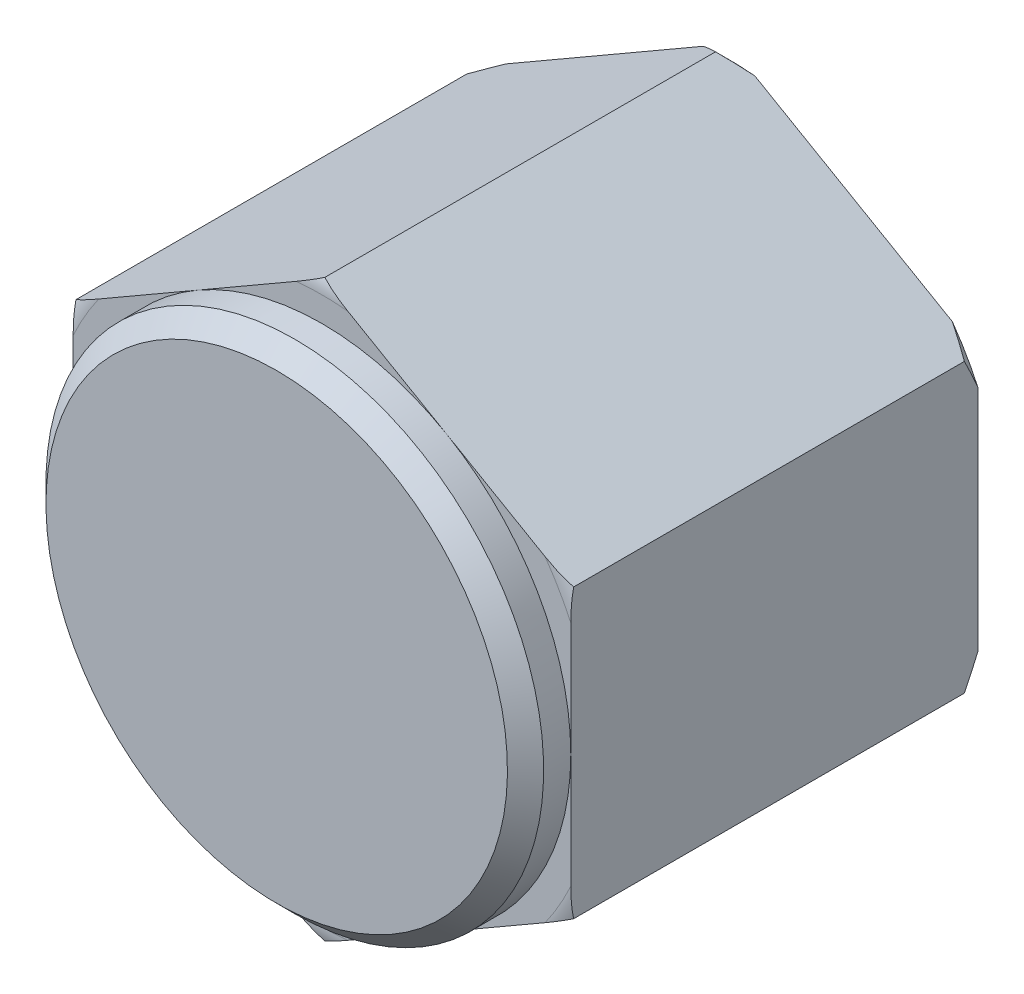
ISO-10303-21;
HEADER;
FILE_DESCRIPTION(('STEP AP214'),'2;1');
FILE_NAME('part.step','',(''),(''),'','','');
FILE_SCHEMA(('AUTOMOTIVE_DESIGN { 1 0 10303 214 1 1 1 1 }'));
ENDSEC;
DATA;
#1=APPLICATION_CONTEXT('core data for automotive mechanical design processes');
#2=APPLICATION_PROTOCOL_DEFINITION('international standard','automotive_design',2000,#1);
#3=PRODUCT_CONTEXT('',#1,'mechanical');
#4=PRODUCT('Part','Part','',(#3));
#5=PRODUCT_RELATED_PRODUCT_CATEGORY('part','',(#4));
#6=PRODUCT_DEFINITION_FORMATION('','',#4);
#7=PRODUCT_DEFINITION_CONTEXT('part definition',#1,'design');
#8=PRODUCT_DEFINITION('design','',#6,#7);
#9=PRODUCT_DEFINITION_SHAPE('','',#8);
#10=(LENGTH_UNIT() NAMED_UNIT(*) SI_UNIT(.MILLI.,.METRE.));
#11=(NAMED_UNIT(*) PLANE_ANGLE_UNIT() SI_UNIT($,.RADIAN.));
#12=(NAMED_UNIT(*) SI_UNIT($,.STERADIAN.) SOLID_ANGLE_UNIT());
#13=UNCERTAINTY_MEASURE_WITH_UNIT(LENGTH_MEASURE(1.E-05),#10,'distance_accuracy_value','');
#14=(GEOMETRIC_REPRESENTATION_CONTEXT(3) GLOBAL_UNCERTAINTY_ASSIGNED_CONTEXT((#13)) GLOBAL_UNIT_ASSIGNED_CONTEXT((#10,
#11,#12)) REPRESENTATION_CONTEXT('',''));
#15=CARTESIAN_POINT('',(0.,0.,0.));
#16=DIRECTION('',(0.,0.,1.));
#17=DIRECTION('',(1.,0.,0.));
#18=AXIS2_PLACEMENT_3D('',#15,#16,#17);
#19=CARTESIAN_POINT('',(11.,0.,18.));
#20=DIRECTION('',(0.,0.,1.));
#21=DIRECTION('',(0.,-1.,0.));
#22=AXIS2_PLACEMENT_3D('',#19,#20,#21);
#23=PLANE('',#22);
#24=DIRECTION('',(0.866025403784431,0.500000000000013,0.));
#25=VECTOR('',#24,1.);
#26=CARTESIAN_POINT('',(2.74999999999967,14.2894191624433,18.));
#27=LINE('',#26,#25);
#28=CARTESIAN_POINT('',(-9.86548966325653,7.00586280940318,18.));
#29=VERTEX_POINT('',#28);
#30=CARTESIAN_POINT('',(-5.50000000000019,9.52627944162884,18.));
#31=VERTEX_POINT('',#30);
#32=EDGE_CURVE('E183',#29,#31,#27,.T.);
#33=ORIENTED_EDGE('',*,*,#32,.F.);
#34=CARTESIAN_POINT('',(0.,0.,18.));
#35=DIRECTION('',(0.,0.,-1.));
#36=DIRECTION('',(0.,1.,0.));
#37=AXIS2_PLACEMENT_3D('',#34,#35,#36);
#38=CIRCLE('',#37,12.1);
#39=CARTESIAN_POINT('',(-11.,5.04083326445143,18.));
#40=VERTEX_POINT('',#39);
#41=EDGE_CURVE('E192',#40,#29,#38,.T.);
#42=ORIENTED_EDGE('',*,*,#41,.F.);
#43=DIRECTION('',(0.,1.,0.));
#44=VECTOR('',#43,1.);
#45=CARTESIAN_POINT('',(-11.,0.,18.));
#46=LINE('',#45,#44);
#47=CARTESIAN_POINT('',(-11.,0.,18.));
#48=VERTEX_POINT('',#47);
#49=EDGE_CURVE('E377',#48,#40,#46,.T.);
#50=ORIENTED_EDGE('',*,*,#49,.F.);
#51=CARTESIAN_POINT('',(0.,0.,18.));
#52=DIRECTION('',(0.,0.,-1.));
#53=DIRECTION('',(0.,1.,0.));
#54=AXIS2_PLACEMENT_3D('',#51,#52,#53);
#55=CIRCLE('',#54,11.);
#56=EDGE_CURVE('E403',#48,#31,#55,.T.);
#57=ORIENTED_EDGE('',*,*,#56,.T.);
#58=EDGE_LOOP('',(#33,#42,#50,#57));
#59=FACE_BOUND('',#58,.T.);
#60=ADVANCED_FACE('F14',(#59),#23,.T.);
#61=CARTESIAN_POINT('',(-11.,-5.04083326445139,18.0000000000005));
#62=VERTEX_POINT('',#61);
#63=EDGE_CURVE('E379',#62,#48,#46,.T.);
#64=ORIENTED_EDGE('',*,*,#63,.F.);
#65=CARTESIAN_POINT('',(-9.86548966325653,-7.00586280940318,18.));
#66=VERTEX_POINT('',#65);
#67=EDGE_CURVE('E355',#66,#62,#38,.T.);
#68=ORIENTED_EDGE('',*,*,#67,.F.);
#69=DIRECTION('',(-0.866025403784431,0.500000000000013,0.));
#70=VECTOR('',#69,1.);
#71=CARTESIAN_POINT('',(2.74999999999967,-14.2894191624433,18.));
#72=LINE('',#71,#70);
#73=CARTESIAN_POINT('',(-5.5000000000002,-9.52627944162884,18.));
#74=VERTEX_POINT('',#73);
#75=EDGE_CURVE('E230',#74,#66,#72,.T.);
#76=ORIENTED_EDGE('',*,*,#75,.F.);
#77=EDGE_CURVE('E394',#74,#48,#55,.T.);
#78=ORIENTED_EDGE('',*,*,#77,.T.);
#79=EDGE_LOOP('',(#64,#68,#76,#78));
#80=FACE_BOUND('',#79,.T.);
#81=ADVANCED_FACE('F391',(#80),#23,.T.);
#82=CARTESIAN_POINT('',(-1.13451033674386,-12.0466960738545,18.));
#83=VERTEX_POINT('',#82);
#84=EDGE_CURVE('E219',#83,#74,#72,.T.);
#85=ORIENTED_EDGE('',*,*,#84,.F.);
#86=CARTESIAN_POINT('',(1.13451033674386,-12.0466960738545,18.));
#87=VERTEX_POINT('',#86);
#88=EDGE_CURVE('E351',#87,#83,#38,.T.);
#89=ORIENTED_EDGE('',*,*,#88,.F.);
#90=DIRECTION('',(-0.866025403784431,-0.500000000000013,0.));
#91=VECTOR('',#90,1.);
#92=CARTESIAN_POINT('',(13.75,-4.76313972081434,18.));
#93=LINE('',#92,#91);
#94=CARTESIAN_POINT('',(5.50000000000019,-9.52627944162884,18.));
#95=VERTEX_POINT('',#94);
#96=EDGE_CURVE('E323',#95,#87,#93,.T.);
#97=ORIENTED_EDGE('',*,*,#96,.F.);
#98=EDGE_CURVE('E449',#95,#74,#55,.T.);
#99=ORIENTED_EDGE('',*,*,#98,.T.);
#100=EDGE_LOOP('',(#85,#89,#97,#99));
#101=FACE_BOUND('',#100,.T.);
#102=ADVANCED_FACE('F478',(#101),#23,.T.);
#103=CARTESIAN_POINT('',(9.86548966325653,-7.00586280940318,18.));
#104=VERTEX_POINT('',#103);
#105=EDGE_CURVE('E324',#104,#95,#93,.T.);
#106=ORIENTED_EDGE('',*,*,#105,.F.);
#107=CARTESIAN_POINT('',(11.,-5.04083326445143,18.));
#108=VERTEX_POINT('',#107);
#109=EDGE_CURVE('E346',#108,#104,#38,.T.);
#110=ORIENTED_EDGE('',*,*,#109,.F.);
#111=DIRECTION('',(0.,-1.,0.));
#112=VECTOR('',#111,1.);
#113=CARTESIAN_POINT('',(11.,0.,18.));
#114=LINE('',#113,#112);
#115=CARTESIAN_POINT('',(11.,0.,18.));
#116=VERTEX_POINT('',#115);
#117=EDGE_CURVE('E442',#116,#108,#114,.T.);
#118=ORIENTED_EDGE('',*,*,#117,.F.);
#119=EDGE_CURVE('E348',#116,#95,#55,.T.);
#120=ORIENTED_EDGE('',*,*,#119,.T.);
#121=EDGE_LOOP('',(#106,#110,#118,#120));
#122=FACE_BOUND('',#121,.T.);
#123=ADVANCED_FACE('F344',(#122),#23,.T.);
#124=CARTESIAN_POINT('',(11.,5.04083326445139,18.0000000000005));
#125=VERTEX_POINT('',#124);
#126=EDGE_CURVE('E443',#125,#116,#114,.T.);
#127=ORIENTED_EDGE('',*,*,#126,.F.);
#128=CARTESIAN_POINT('',(9.86548966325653,7.00586280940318,18.));
#129=VERTEX_POINT('',#128);
#130=EDGE_CURVE('E193',#129,#125,#38,.T.);
#131=ORIENTED_EDGE('',*,*,#130,.F.);
#132=DIRECTION('',(0.866025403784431,-0.500000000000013,0.));
#133=VECTOR('',#132,1.);
#134=CARTESIAN_POINT('',(13.75,4.76313972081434,18.));
#135=LINE('',#134,#133);
#136=CARTESIAN_POINT('',(5.50000000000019,9.52627944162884,18.));
#137=VERTEX_POINT('',#136);
#138=EDGE_CURVE('E29',#137,#129,#135,.T.);
#139=ORIENTED_EDGE('',*,*,#138,.F.);
#140=EDGE_CURVE('E357',#137,#116,#55,.T.);
#141=ORIENTED_EDGE('',*,*,#140,.T.);
#142=EDGE_LOOP('',(#127,#131,#139,#141));
#143=FACE_BOUND('',#142,.T.);
#144=ADVANCED_FACE('F451',(#143),#23,.T.);
#145=CARTESIAN_POINT('',(0.,0.,16.5000000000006));
#146=DIRECTION('',(0.,0.,-1.));
#147=DIRECTION('',(0.,1.,0.));
#148=AXIS2_PLACEMENT_3D('',#145,#146,#147);
#149=TOROIDAL_SURFACE('',#148,12.1000000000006,1.49999999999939);
#150=CARTESIAN_POINT('',(-11.0002,6.35073749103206,17.8739763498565));
#151=CARTESIAN_POINT('',(-10.9240344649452,6.3947116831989,17.8932144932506));
#152=CARTESIAN_POINT('',(-10.8474018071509,6.4389555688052,17.9098037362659));
#153=CARTESIAN_POINT('',(-10.6935372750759,6.52778929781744,17.9382785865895));
#154=CARTESIAN_POINT('',(-10.6163058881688,6.57237885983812,17.9501676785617));
#155=CARTESIAN_POINT('',(-10.4616551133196,6.66166652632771,17.9698389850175));
#156=CARTESIAN_POINT('',(-10.38423665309,6.70636409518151,17.9776312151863));
#157=CARTESIAN_POINT('',(-10.2291820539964,6.79588490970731,17.9896427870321));
#158=CARTESIAN_POINT('',(-10.1515458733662,6.84070817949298,17.993861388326));
#159=CARTESIAN_POINT('',(-9.91922358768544,6.97483951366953,18.0017958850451));
#160=CARTESIAN_POINT('',(-9.76441551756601,7.06421799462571,18.0008718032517));
#161=CARTESIAN_POINT('',(-9.45504767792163,7.24283160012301,17.9895091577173));
#162=CARTESIAN_POINT('',(-9.30048806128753,7.33206663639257,17.979066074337));
#163=CARTESIAN_POINT('',(-8.95702003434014,7.53036799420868,17.9479275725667));
#164=CARTESIAN_POINT('',(-8.76823771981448,7.63936151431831,17.9254493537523));
#165=CARTESIAN_POINT('',(-8.39135194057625,7.85695662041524,17.8738495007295));
#166=CARTESIAN_POINT('',(-8.20324865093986,7.96555810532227,17.8447262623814));
#167=CARTESIAN_POINT('',(-7.82725724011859,8.18263684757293,17.7837487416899));
#168=CARTESIAN_POINT('',(-7.63936934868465,8.29111397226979,17.7518926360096));
#169=CARTESIAN_POINT('',(-7.26338987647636,8.50818582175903,17.6896886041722));
#170=CARTESIAN_POINT('',(-7.07529828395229,8.61678055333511,17.6593407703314));
#171=CARTESIAN_POINT('',(-6.69686289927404,8.83527032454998,17.6046424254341));
#172=CARTESIAN_POINT('',(-6.5065131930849,8.94516877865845,17.5803423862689));
#173=CARTESIAN_POINT('',(-6.22039782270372,9.11035756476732,17.5521958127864));
#174=CARTESIAN_POINT('',(-6.12494318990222,9.16546832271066,17.5441981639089));
#175=CARTESIAN_POINT('',(-5.93387488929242,9.27578165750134,17.531425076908));
#176=CARTESIAN_POINT('',(-5.83826123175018,9.33098422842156,17.526649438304));
#177=CARTESIAN_POINT('',(-5.64704623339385,9.44138225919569,17.5206285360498));
#178=CARTESIAN_POINT('',(-5.55144497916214,9.49657766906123,17.519379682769));
#179=CARTESIAN_POINT('',(-5.36025820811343,9.6069594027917,17.5204829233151));
#180=CARTESIAN_POINT('',(-5.26467269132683,9.66214572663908,17.5228350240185));
#181=CARTESIAN_POINT('',(-5.07358653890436,9.77246936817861,17.5309890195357));
#182=CARTESIAN_POINT('',(-4.97808593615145,9.82760666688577,17.5367919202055));
#183=CARTESIAN_POINT('',(-4.78726064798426,9.93777969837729,17.5514865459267));
#184=CARTESIAN_POINT('',(-4.69193597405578,9.99281542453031,17.5603784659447));
#185=CARTESIAN_POINT('',(-4.40908136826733,10.1561216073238,17.5906412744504));
#186=CARTESIAN_POINT('',(-4.22185644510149,10.2642159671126,17.6157476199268));
#187=CARTESIAN_POINT('',(-3.84807348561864,10.4800196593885,17.6714173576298));
#188=CARTESIAN_POINT('',(-3.66151541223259,10.5877290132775,17.7019804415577));
#189=CARTESIAN_POINT('',(-3.28854679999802,10.8030625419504,17.7640205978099));
#190=CARTESIAN_POINT('',(-3.10213624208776,10.9106867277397,17.7954975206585));
#191=CARTESIAN_POINT('',(-2.72884649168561,11.1262056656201,17.8553087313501));
#192=CARTESIAN_POINT('',(-2.54196714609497,11.2341005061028,17.8836418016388));
#193=CARTESIAN_POINT('',(-2.1602310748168,11.4544959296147,17.9342695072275));
#194=CARTESIAN_POINT('',(-1.96534564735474,11.567013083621,17.9562878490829));
#195=CARTESIAN_POINT('',(-1.57500208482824,11.7923780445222,17.9883177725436));
#196=CARTESIAN_POINT('',(-1.37954510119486,11.9052251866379,17.9983457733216));
#197=CARTESIAN_POINT('',(-1.08499335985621,12.07528471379,18.0005556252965));
#198=CARTESIAN_POINT('',(-0.985936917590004,12.1324749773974,17.9991015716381));
#199=CARTESIAN_POINT('',(-0.788009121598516,12.2467486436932,17.9909854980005));
#200=CARTESIAN_POINT('',(-0.689137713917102,12.3038320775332,17.9843253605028));
#201=CARTESIAN_POINT('',(-0.491326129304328,12.4180386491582,17.9648199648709));
#202=CARTESIAN_POINT('',(-0.392388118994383,12.4751605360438,17.9519436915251));
#203=CARTESIAN_POINT('',(-0.244615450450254,12.5604771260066,17.9271182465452));
#204=CARTESIAN_POINT('',(-0.195431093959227,12.5888737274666,17.9179166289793));
#205=CARTESIAN_POINT('',(-0.0973650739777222,12.6454921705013,17.8974999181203));
#206=CARTESIAN_POINT('',(-0.0484834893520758,12.6737139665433,17.8862843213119));
#207=CARTESIAN_POINT('',(0.000199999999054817,12.7018213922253,17.8739763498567));
#208=B_SPLINE_CURVE_WITH_KNOTS('',3,(#150,#151,#152,#153,#154,#155,#156,#157,#158,#159,#160,
#161,#162,#163,#164,#165,#166,#167,#168,#169,#170,#171,#172,#173,#174,#175,#176,#177,#178,#179,
#180,#181,#182,#183,#184,#185,#186,#187,#188,#189,#190,#191,#192,#193,#194,#195,#196,#197,#198,
#199,#200,#201,#202,#203,#204,#205,#206,#207),.UNSPECIFIED.,.F.,.F.,(4,2,2,2,2,2,2,2,2,2,2,2,2,
2,2,2,2,2,2,2,2,2,2,2,2,2,2,2,4),(0.,0.269986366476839,0.539772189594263,0.808895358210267,
1.07807427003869,1.61397266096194,2.15012563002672,2.80736813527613,3.46476947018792,
4.12261287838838,4.78049650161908,5.44369909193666,5.77519220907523,6.10666469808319,
6.43779968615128,6.76893530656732,7.10016749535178,7.43142059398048,8.08417886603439,
8.73690026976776,9.38951550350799,10.0423826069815,10.7205292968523,11.3977462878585,
11.7408195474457,12.0837688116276,12.4284471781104,12.6010162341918,12.7736284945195),.UNSPECIFIED.);
#209=CARTESIAN_POINT('',(-11.,6.3508529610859,17.8740269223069));
#210=VERTEX_POINT('',#209);
#211=EDGE_CURVE('E179',#210,#29,#208,.T.);
#212=ORIENTED_EDGE('',*,*,#211,.F.);
#213=CARTESIAN_POINT('',(-11.,0.,17.5198039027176));
#214=CARTESIAN_POINT('',(-11.,0.124987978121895,17.5197973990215));
#215=CARTESIAN_POINT('',(-11.,0.249971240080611,17.5221161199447));
#216=CARTESIAN_POINT('',(-11.,0.499780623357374,17.53118204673));
#217=CARTESIAN_POINT('',(-11.,0.624606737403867,17.5379294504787));
#218=CARTESIAN_POINT('',(-11.,0.874140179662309,17.5553369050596));
#219=CARTESIAN_POINT('',(-11.,0.998847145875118,17.5660020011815));
#220=CARTESIAN_POINT('',(-11.,1.24795610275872,17.5904785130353));
#221=CARTESIAN_POINT('',(-11.,1.37235806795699,17.6042901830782));
#222=CARTESIAN_POINT('',(-11.,1.74783905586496,17.6494516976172));
#223=CARTESIAN_POINT('',(-11.,1.99848289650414,17.6843025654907));
#224=CARTESIAN_POINT('',(-11.,2.4993108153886,17.756028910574));
#225=CARTESIAN_POINT('',(-11.,2.74949506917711,17.7929032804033));
#226=CARTESIAN_POINT('',(-11.,3.25081681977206,17.8622879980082));
#227=CARTESIAN_POINT('',(-11.,3.5019551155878,17.8947928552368));
#228=CARTESIAN_POINT('',(-11.,4.00569766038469,17.9493951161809));
#229=CARTESIAN_POINT('',(-11.,4.25830298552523,17.9714835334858));
#230=CARTESIAN_POINT('',(-11.,4.63678887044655,17.9918635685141));
#231=CARTESIAN_POINT('',(-11.,4.7623172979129,17.9965386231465));
#232=CARTESIAN_POINT('',(-11.,5.01345193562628,18.0008213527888));
#233=CARTESIAN_POINT('',(-11.,5.13905812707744,18.0004299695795));
#234=CARTESIAN_POINT('',(-11.,5.38991647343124,17.9935639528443));
#235=CARTESIAN_POINT('',(-11.,5.51516887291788,17.9870990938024));
#236=CARTESIAN_POINT('',(-11.,5.76506516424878,17.9669002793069));
#237=CARTESIAN_POINT('',(-11.,5.88970931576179,17.9531697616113));
#238=CARTESIAN_POINT('',(-11.,6.09072899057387,17.9238343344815));
#239=CARTESIAN_POINT('',(-11.,6.1674972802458,17.9109112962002));
#240=CARTESIAN_POINT('',(-11.,6.32031835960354,17.8812694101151));
#241=CARTESIAN_POINT('',(-11.,6.39637104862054,17.8645500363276));
#242=CARTESIAN_POINT('',(-11.,6.54751140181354,17.8268095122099));
#243=CARTESIAN_POINT('',(-11.,6.62259781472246,17.8057832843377));
#244=CARTESIAN_POINT('',(-11.,6.77122248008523,17.7588767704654));
#245=CARTESIAN_POINT('',(-11.,6.84476115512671,17.7329978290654));
#246=CARTESIAN_POINT('',(-11.,7.02539523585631,17.6616193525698));
#247=CARTESIAN_POINT('',(-11.,7.13119219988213,17.6127319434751));
#248=CARTESIAN_POINT('',(-11.,7.33457051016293,17.5000762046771));
#249=CARTESIAN_POINT('',(-11.,7.43217165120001,17.4363452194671));
#250=CARTESIAN_POINT('',(-11.,7.5786886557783,17.3189046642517));
#251=CARTESIAN_POINT('',(-11.,7.6319630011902,17.2706622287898));
#252=CARTESIAN_POINT('',(-11.,7.73091500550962,17.1668749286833));
#253=CARTESIAN_POINT('',(-11.,7.77660232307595,17.1113395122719));
#254=CARTESIAN_POINT('',(-11.,7.84945660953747,17.004744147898));
#255=CARTESIAN_POINT('',(-11.,7.87849952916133,16.954977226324));
#256=CARTESIAN_POINT('',(-11.,7.9280558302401,16.8513293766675));
#257=CARTESIAN_POINT('',(-11.,7.94857551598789,16.7974515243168));
#258=CARTESIAN_POINT('',(-11.,7.97955937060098,16.686338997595));
#259=CARTESIAN_POINT('',(-11.,7.98993900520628,16.6290802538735));
#260=CARTESIAN_POINT('',(-11.,7.99928295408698,16.5136433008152));
#261=CARTESIAN_POINT('',(-11.,7.99825398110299,16.4554656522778));
#262=CARTESIAN_POINT('',(-11.,7.9857922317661,16.347940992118));
#263=CARTESIAN_POINT('',(-11.,7.97572694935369,16.2984277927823));
#264=CARTESIAN_POINT('',(-11.,7.94783687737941,16.2016543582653));
#265=CARTESIAN_POINT('',(-11.,7.93000911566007,16.1543949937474));
#266=CARTESIAN_POINT('',(-11.,7.88102131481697,16.0485753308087));
#267=CARTESIAN_POINT('',(-11.,7.84743067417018,15.9911436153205));
#268=CARTESIAN_POINT('',(-11.,7.77141688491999,15.8824839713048));
#269=CARTESIAN_POINT('',(-11.,7.72897788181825,15.8312674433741));
#270=CARTESIAN_POINT('',(-11.,7.61600405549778,15.7123506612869));
#271=CARTESIAN_POINT('',(-11.,7.54166562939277,15.6482880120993));
#272=CARTESIAN_POINT('',(-11.,7.38408670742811,15.5322746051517));
#273=CARTESIAN_POINT('',(-11.,7.30082380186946,15.4803554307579));
#274=CARTESIAN_POINT('',(-11.,7.14102746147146,15.3936592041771));
#275=CARTESIAN_POINT('',(-11.,7.06523167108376,15.357492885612));
#276=CARTESIAN_POINT('',(-11.,6.91077524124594,15.291817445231));
#277=CARTESIAN_POINT('',(-11.,6.83211250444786,15.2623133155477));
#278=CARTESIAN_POINT('',(-11.,6.67289153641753,15.2091308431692));
#279=CARTESIAN_POINT('',(-11.,6.59233382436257,15.1854509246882));
#280=CARTESIAN_POINT('',(-11.,6.42987926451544,15.1431627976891));
#281=CARTESIAN_POINT('',(-11.,6.34798185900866,15.1245567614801));
#282=CARTESIAN_POINT('',(-11.,6.16301093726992,15.0877648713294));
#283=CARTESIAN_POINT('',(-11.,6.05969338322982,15.0708129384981));
#284=CARTESIAN_POINT('',(-11.,5.85228467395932,15.0428324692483));
#285=CARTESIAN_POINT('',(-11.,5.74819350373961,15.0318040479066));
#286=CARTESIAN_POINT('',(-11.,5.43501708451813,15.0062894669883));
#287=CARTESIAN_POINT('',(-11.,5.22530725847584,14.9994241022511));
#288=CARTESIAN_POINT('',(-11.,4.80440402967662,15.0006536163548));
#289=CARTESIAN_POINT('',(-11.,4.5932123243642,15.0088697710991));
#290=CARTESIAN_POINT('',(-11.,4.17161774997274,15.0362443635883));
#291=CARTESIAN_POINT('',(-11.,3.96121478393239,15.0554014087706));
#292=CARTESIAN_POINT('',(-11.,3.48493378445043,15.1070842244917));
#293=CARTESIAN_POINT('',(-11.,3.21930902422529,15.1418173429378));
#294=CARTESIAN_POINT('',(-11.,2.68859494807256,15.2158282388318));
#295=CARTESIAN_POINT('',(-11.,2.42350602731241,15.2551086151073));
#296=CARTESIAN_POINT('',(-11.,1.89379558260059,15.330305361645));
#297=CARTESIAN_POINT('',(-11.,1.62917596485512,15.3662336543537));
#298=CARTESIAN_POINT('',(-11.,1.2313064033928,15.4112847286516));
#299=CARTESIAN_POINT('',(-11.,1.09857506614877,15.4248248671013));
#300=CARTESIAN_POINT('',(-11.,0.832773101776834,15.4479385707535));
#301=CARTESIAN_POINT('',(-11.,0.699702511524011,15.4575125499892));
#302=CARTESIAN_POINT('',(-11.,0.433549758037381,15.4718618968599));
#303=CARTESIAN_POINT('',(-11.,0.300468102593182,15.4766463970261));
#304=CARTESIAN_POINT('',(-11.,0.0342188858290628,15.4810033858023));
#305=CARTESIAN_POINT('',(-11.,-0.0989486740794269,15.480575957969));
#306=CARTESIAN_POINT('',(-11.,-0.365218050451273,15.4745478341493));
#307=CARTESIAN_POINT('',(-11.,-0.498319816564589,15.4689449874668));
#308=CARTESIAN_POINT('',(-11.,-0.764243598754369,15.4530835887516));
#309=CARTESIAN_POINT('',(-11.,-0.897065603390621,15.4428248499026));
#310=CARTESIAN_POINT('',(-11.,-1.29604325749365,15.4062369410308));
#311=CARTESIAN_POINT('',(-11.,-1.56165044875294,15.3741320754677));
#312=CARTESIAN_POINT('',(-11.,-2.09189035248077,15.3031603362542));
#313=CARTESIAN_POINT('',(-11.,-2.35652293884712,15.2642926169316));
#314=CARTESIAN_POINT('',(-11.,-2.75340306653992,15.2070805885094));
#315=CARTESIAN_POINT('',(-11.,-2.8855670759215,15.1882078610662));
#316=CARTESIAN_POINT('',(-11.,-3.15005565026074,15.1517218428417));
#317=CARTESIAN_POINT('',(-11.,-3.28238020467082,15.1341084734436));
#318=CARTESIAN_POINT('',(-11.,-3.67956151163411,15.0845156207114));
#319=CARTESIAN_POINT('',(-11.,-3.94486596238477,15.0557454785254));
#320=CARTESIAN_POINT('',(-11.,-4.34332266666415,15.0244819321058));
#321=CARTESIAN_POINT('',(-11.,-4.47599831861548,15.0160470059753));
#322=CARTESIAN_POINT('',(-11.,-4.74156311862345,15.004094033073));
#323=CARTESIAN_POINT('',(-11.,-4.87445222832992,15.0005751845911));
#324=CARTESIAN_POINT('',(-11.,-5.14014713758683,14.9995542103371));
#325=CARTESIAN_POINT('',(-11.,-5.27295290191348,15.0020465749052));
#326=CARTESIAN_POINT('',(-11.,-5.53820788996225,15.0143134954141));
#327=CARTESIAN_POINT('',(-11.,-5.67065723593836,15.024085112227));
#328=CARTESIAN_POINT('',(-11.,-5.90219354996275,15.0489682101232));
#329=CARTESIAN_POINT('',(-11.,-6.00148277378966,15.0621780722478));
#330=CARTESIAN_POINT('',(-11.,-6.19915458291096,15.0944300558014));
#331=CARTESIAN_POINT('',(-11.,-6.29753694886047,15.1134735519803));
#332=CARTESIAN_POINT('',(-11.,-6.49264594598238,15.1583254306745));
#333=CARTESIAN_POINT('',(-11.,-6.58937447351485,15.1841254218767));
#334=CARTESIAN_POINT('',(-11.,-6.78032646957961,15.2436495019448));
#335=CARTESIAN_POINT('',(-11.,-6.87455189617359,15.2773671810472));
#336=CARTESIAN_POINT('',(-11.,-7.05540127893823,15.3525923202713));
#337=CARTESIAN_POINT('',(-11.,-7.14217852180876,15.3937256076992));
#338=CARTESIAN_POINT('',(-11.,-7.3102655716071,15.4861178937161));
#339=CARTESIAN_POINT('',(-11.,-7.39157776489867,15.5373724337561));
#340=CARTESIAN_POINT('',(-11.,-7.53350894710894,15.6426631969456));
#341=CARTESIAN_POINT('',(-11.,-7.59537277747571,15.6950003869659));
#342=CARTESIAN_POINT('',(-11.,-7.7100500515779,15.8088542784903));
#343=CARTESIAN_POINT('',(-11.,-7.76288116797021,15.8703526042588));
#344=CARTESIAN_POINT('',(-11.,-7.84188713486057,15.9831701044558));
#345=CARTESIAN_POINT('',(-11.,-7.87133558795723,16.0321850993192));
#346=CARTESIAN_POINT('',(-11.,-7.92198542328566,16.134336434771));
#347=CARTESIAN_POINT('',(-11.,-7.94319350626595,16.1874693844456));
#348=CARTESIAN_POINT('',(-11.,-7.97585528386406,16.29719458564));
#349=CARTESIAN_POINT('',(-11.,-7.98722616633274,16.3538119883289));
#350=CARTESIAN_POINT('',(-11.,-7.9987823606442,16.4681763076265));
#351=CARTESIAN_POINT('',(-11.,-7.99897431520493,16.5259225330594));
#352=CARTESIAN_POINT('',(-11.,-7.98883538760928,16.6334221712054));
#353=CARTESIAN_POINT('',(-11.,-7.97976836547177,16.6833009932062));
#354=CARTESIAN_POINT('',(-11.,-7.9537041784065,16.7809250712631));
#355=CARTESIAN_POINT('',(-11.,-7.93670404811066,16.8286695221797));
#356=CARTESIAN_POINT('',(-11.,-7.88993188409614,16.9345101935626));
#357=CARTESIAN_POINT('',(-11.,-7.85788658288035,16.9915983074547));
#358=CARTESIAN_POINT('',(-11.,-7.78497379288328,17.0998130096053));
#359=CARTESIAN_POINT('',(-11.,-7.74409024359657,17.1509284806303));
#360=CARTESIAN_POINT('',(-11.,-7.6354338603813,17.269236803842));
#361=CARTESIAN_POINT('',(-11.,-7.56394739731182,17.3329962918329));
#362=CARTESIAN_POINT('',(-11.,-7.41208750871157,17.4487792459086));
#363=CARTESIAN_POINT('',(-11.,-7.33169532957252,17.5007772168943));
#364=CARTESIAN_POINT('',(-11.,-7.17775819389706,17.5875556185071));
#365=CARTESIAN_POINT('',(-11.,-7.10499260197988,17.6237485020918));
#366=CARTESIAN_POINT('',(-11.,-6.95658332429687,17.6897350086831));
#367=CARTESIAN_POINT('',(-11.,-6.88093757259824,17.7195239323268));
#368=CARTESIAN_POINT('',(-11.,-6.7276009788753,17.7735198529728));
#369=CARTESIAN_POINT('',(-11.,-6.64990777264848,17.7977200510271));
#370=CARTESIAN_POINT('',(-11.,-6.49314260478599,17.8411921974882));
#371=CARTESIAN_POINT('',(-11.,-6.41407011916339,17.8604622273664));
#372=CARTESIAN_POINT('',(-11.,-6.17498520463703,17.9118816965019));
#373=CARTESIAN_POINT('',(-11.,-6.01355762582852,17.9374904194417));
#374=CARTESIAN_POINT('',(-11.,-5.68908214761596,17.975098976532));
#375=CARTESIAN_POINT('',(-11.,-5.52603257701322,17.9870828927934));
#376=CARTESIAN_POINT('',(-11.,-5.19893892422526,18.0002875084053));
#377=CARTESIAN_POINT('',(-11.,-5.03489339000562,18.0014684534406));
#378=CARTESIAN_POINT('',(-11.,-4.70713535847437,17.9952858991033));
#379=CARTESIAN_POINT('',(-11.,-4.54342269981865,17.9879292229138));
#380=CARTESIAN_POINT('',(-11.,-4.19602458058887,17.9653040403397));
#381=CARTESIAN_POINT('',(-11.,-4.01239884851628,17.9491619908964));
#382=CARTESIAN_POINT('',(-11.,-3.64574950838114,17.9110118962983));
#383=CARTESIAN_POINT('',(-11.,-3.46272602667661,17.8890026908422));
#384=CARTESIAN_POINT('',(-11.,-3.09681597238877,17.8414100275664));
#385=CARTESIAN_POINT('',(-11.,-2.91393027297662,17.8158200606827));
#386=CARTESIAN_POINT('',(-11.,-2.54833575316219,17.7634917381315));
#387=CARTESIAN_POINT('',(-11.,-2.3656269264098,17.7367534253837));
#388=CARTESIAN_POINT('',(-11.,-2.00165544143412,17.6849390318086));
#389=CARTESIAN_POINT('',(-11.,-1.8203946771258,17.6598500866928));
#390=CARTESIAN_POINT('',(-11.,-1.45732831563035,17.6137998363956));
#391=CARTESIAN_POINT('',(-11.,-1.27552272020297,17.5928385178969));
#392=CARTESIAN_POINT('',(-11.,-0.911663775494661,17.5578450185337));
#393=CARTESIAN_POINT('',(-11.,-0.729612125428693,17.5437959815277));
#394=CARTESIAN_POINT('',(-11.,-0.365036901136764,17.5247810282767));
#395=CARTESIAN_POINT('',(-11.,-0.182513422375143,17.5198133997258));
#396=CARTESIAN_POINT('',(-11.,0.,17.5198039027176));
#397=B_SPLINE_CURVE_WITH_KNOTS('',3,(#213,#214,#215,#216,#217,#218,#219,#220,#221,#222,#223,
#224,#225,#226,#227,#228,#229,#230,#231,#232,#233,#234,#235,#236,#237,#238,#239,#240,#241,#242,
#243,#244,#245,#246,#247,#248,#249,#250,#251,#252,#253,#254,#255,#256,#257,#258,#259,#260,#261,
#262,#263,#264,#265,#266,#267,#268,#269,#270,#271,#272,#273,#274,#275,#276,#277,#278,#279,#280,
#281,#282,#283,#284,#285,#286,#287,#288,#289,#290,#291,#292,#293,#294,#295,#296,#297,#298,#299,
#300,#301,#302,#303,#304,#305,#306,#307,#308,#309,#310,#311,#312,#313,#314,#315,#316,#317,#318,
#319,#320,#321,#322,#323,#324,#325,#326,#327,#328,#329,#330,#331,#332,#333,#334,#335,#336,#337,
#338,#339,#340,#341,#342,#343,#344,#345,#346,#347,#348,#349,#350,#351,#352,#353,#354,#355,#356,
#357,#358,#359,#360,#361,#362,#363,#364,#365,#366,#367,#368,#369,#370,#371,#372,#373,#374,#375,
#376,#377,#378,#379,#380,#381,#382,#383,#384,#385,#386,#387,#388,#389,#390,#391,#392,#393,#394,
#395,#396),.UNSPECIFIED.,.T.,.F.,(4,2,2,2,2,2,2,2,2,2,2,2,2,2,2,2,2,2,2,2,2,2,2,2,2,2,2,2,2,2,2,
2,2,2,2,2,2,2,2,2,2,2,2,2,2,2,2,2,2,2,2,2,2,2,2,2,2,2,2,2,2,2,2,2,2,2,2,2,2,2,2,2,2,2,2,2,2,2,2,
2,2,2,2,2,2,2,2,2,2,2,2,4),(0.,0.374935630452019,0.749888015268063,1.12532497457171,
1.50079228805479,2.25987909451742,3.0185545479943,3.77817458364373,4.53844876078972,
4.91521441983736,5.29191004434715,5.66800046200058,6.0439130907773,6.27737897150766,
6.5108772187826,6.74465234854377,6.97836279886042,7.32710266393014,7.67497444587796,
7.89000028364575,8.10475024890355,8.27695571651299,8.44903358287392,8.62253406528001,
8.79593246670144,8.94682791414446,9.09778118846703,9.29627711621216,9.49513181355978,
9.78789396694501,10.0814092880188,10.3329980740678,10.5847747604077,10.8364832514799,
11.0882993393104,11.4021828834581,11.7160725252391,12.344696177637,12.9783969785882,
13.6120171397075,14.4155426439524,15.2195296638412,16.0205384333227,16.4207512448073,
16.8209222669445,17.2203287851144,17.6197289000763,18.0192950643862,18.4188772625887,
19.2212178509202,20.0236588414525,20.424165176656,20.8246464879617,21.6248801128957,
22.0236397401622,22.4223343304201,22.8206636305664,23.218832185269,23.5191818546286,
23.8196023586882,24.1196515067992,24.4194585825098,24.7070272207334,24.9944694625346,
25.2367994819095,25.4786498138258,25.6495716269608,25.8203541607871,25.9925607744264,
26.1646650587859,26.3160530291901,26.4674976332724,26.6628158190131,26.8584919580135,
27.1442607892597,27.4306432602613,27.6741077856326,27.9177503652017,28.1616878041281,
28.4057200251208,28.8952056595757,29.3852625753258,29.8771221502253,30.3685889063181,
30.9214495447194,31.4744195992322,32.0284082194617,32.5823761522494,33.1313254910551,
33.6802730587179,34.2278752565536,34.7753741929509),.UNSPECIFIED.);
#398=EDGE_CURVE('E378',#40,#210,#397,.T.);
#399=ORIENTED_EDGE('',*,*,#398,.F.);
#400=ORIENTED_EDGE('',*,*,#41,.T.);
#401=EDGE_LOOP('',(#212,#399,#400));
#402=FACE_BOUND('',#401,.T.);
#403=ADVANCED_FACE('F276',(#402),#149,.T.);
#404=CARTESIAN_POINT('',(-11.,-6.3508529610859,17.8740269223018));
#405=VERTEX_POINT('',#404);
#406=EDGE_CURVE('E218',#405,#62,#397,.T.);
#407=ORIENTED_EDGE('',*,*,#406,.F.);
#408=CARTESIAN_POINT('',(0.00019999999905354,-12.7018213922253,17.8739763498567));
#409=CARTESIAN_POINT('',(-0.0759655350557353,-12.6578472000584,17.8932144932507));
#410=CARTESIAN_POINT('',(-0.152598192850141,-12.6136033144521,17.909803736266));
#411=CARTESIAN_POINT('',(-0.3064627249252,-12.5247695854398,17.9382785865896));
#412=CARTESIAN_POINT('',(-0.383694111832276,-12.4801800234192,17.9501676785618));
#413=CARTESIAN_POINT('',(-0.538344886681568,-12.3908923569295,17.9698389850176));
#414=CARTESIAN_POINT('',(-0.615763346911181,-12.3461947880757,17.9776312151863));
#415=CARTESIAN_POINT('',(-0.770817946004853,-12.2566739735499,17.9896427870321));
#416=CARTESIAN_POINT('',(-0.84845412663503,-12.2118507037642,17.993861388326));
#417=CARTESIAN_POINT('',(-1.08077641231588,-12.0777193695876,18.0017958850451));
#418=CARTESIAN_POINT('',(-1.23558448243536,-11.9883408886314,18.0008718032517));
#419=CARTESIAN_POINT('',(-1.54495232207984,-11.809727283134,17.9895091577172));
#420=CARTESIAN_POINT('',(-1.69951193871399,-11.7204922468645,17.9790660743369));
#421=CARTESIAN_POINT('',(-2.04297996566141,-11.5221908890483,17.9479275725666));
#422=CARTESIAN_POINT('',(-2.23176228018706,-11.4131973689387,17.9254493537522));
#423=CARTESIAN_POINT('',(-2.60864805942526,-11.1956022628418,17.8738495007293));
#424=CARTESIAN_POINT('',(-2.79675134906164,-11.0870007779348,17.8447262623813));
#425=CARTESIAN_POINT('',(-3.17274275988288,-10.8699220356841,17.7837487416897));
#426=CARTESIAN_POINT('',(-3.3606306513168,-10.7614449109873,17.7518926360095));
#427=CARTESIAN_POINT('',(-3.73661012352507,-10.544373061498,17.689688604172));
#428=CARTESIAN_POINT('',(-3.92470171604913,-10.435778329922,17.6593407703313));
#429=CARTESIAN_POINT('',(-4.30313710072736,-10.2172885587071,17.604642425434));
#430=CARTESIAN_POINT('',(-4.49348680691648,-10.1073901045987,17.5803423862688));
#431=CARTESIAN_POINT('',(-4.77960217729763,-9.9422013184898,17.5521958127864));
#432=CARTESIAN_POINT('',(-4.87505681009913,-9.88709056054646,17.5441981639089));
#433=CARTESIAN_POINT('',(-5.06612511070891,-9.77677722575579,17.531425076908));
#434=CARTESIAN_POINT('',(-5.16173876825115,-9.72157465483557,17.526649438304));
#435=CARTESIAN_POINT('',(-5.35295376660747,-9.61117662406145,17.5206285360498));
#436=CARTESIAN_POINT('',(-5.44855502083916,-9.55598121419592,17.519379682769));
#437=CARTESIAN_POINT('',(-5.63974179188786,-9.44559948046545,17.5204829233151));
#438=CARTESIAN_POINT('',(-5.73532730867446,-9.39041315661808,17.5228350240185));
#439=CARTESIAN_POINT('',(-5.92641346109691,-9.28008951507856,17.5309890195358));
#440=CARTESIAN_POINT('',(-6.02191406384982,-9.2249522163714,17.5367919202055));
#441=CARTESIAN_POINT('',(-6.21273935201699,-9.11477918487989,17.5514865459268));
#442=CARTESIAN_POINT('',(-6.30806402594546,-9.05974345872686,17.5603784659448));
#443=CARTESIAN_POINT('',(-6.59091863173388,-8.89643727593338,17.5906412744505));
#444=CARTESIAN_POINT('',(-6.77814355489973,-8.78834291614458,17.6157476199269));
#445=CARTESIAN_POINT('',(-7.15192651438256,-8.57253922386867,17.6714173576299));
#446=CARTESIAN_POINT('',(-7.33848458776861,-8.46482986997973,17.7019804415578));
#447=CARTESIAN_POINT('',(-7.71145320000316,-8.24949634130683,17.76402059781));
#448=CARTESIAN_POINT('',(-7.8978637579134,-8.14187215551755,17.7954975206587));
#449=CARTESIAN_POINT('',(-8.27115350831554,-7.92635321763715,17.8553087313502));
#450=CARTESIAN_POINT('',(-8.45803285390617,-7.81845837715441,17.8836418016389));
#451=CARTESIAN_POINT('',(-8.83976892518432,-7.59806295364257,17.9342695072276));
#452=CARTESIAN_POINT('',(-9.03465435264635,-7.48554579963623,17.956287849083));
#453=CARTESIAN_POINT('',(-9.42499791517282,-7.26018083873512,17.9883177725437));
#454=CARTESIAN_POINT('',(-9.62045489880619,-7.1473336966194,17.9983457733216));
#455=CARTESIAN_POINT('',(-9.91500664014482,-6.97727416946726,18.0005556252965));
#456=CARTESIAN_POINT('',(-10.014063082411,-6.92008390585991,17.9991015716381));
#457=CARTESIAN_POINT('',(-10.2119908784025,-6.80581023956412,17.9909854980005));
#458=CARTESIAN_POINT('',(-10.3108622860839,-6.7487268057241,17.9843253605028));
#459=CARTESIAN_POINT('',(-10.5086738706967,-6.63452023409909,17.9648199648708));
#460=CARTESIAN_POINT('',(-10.6076118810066,-6.57739834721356,17.9519436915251));
#461=CARTESIAN_POINT('',(-10.7553845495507,-6.49208175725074,17.9271182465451));
#462=CARTESIAN_POINT('',(-10.8045689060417,-6.46368515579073,17.9179166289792));
#463=CARTESIAN_POINT('',(-10.9026349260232,-6.40706671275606,17.8974999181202));
#464=CARTESIAN_POINT('',(-10.9515165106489,-6.37884491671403,17.8862843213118));
#465=CARTESIAN_POINT('',(-11.0002,-6.35073749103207,17.8739763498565));
#466=B_SPLINE_CURVE_WITH_KNOTS('',3,(#408,#409,#410,#411,#412,#413,#414,#415,#416,#417,#418,
#419,#420,#421,#422,#423,#424,#425,#426,#427,#428,#429,#430,#431,#432,#433,#434,#435,#436,#437,
#438,#439,#440,#441,#442,#443,#444,#445,#446,#447,#448,#449,#450,#451,#452,#453,#454,#455,#456,
#457,#458,#459,#460,#461,#462,#463,#464,#465),.UNSPECIFIED.,.F.,.F.,(4,2,2,2,2,2,2,2,2,2,2,2,2,
2,2,2,2,2,2,2,2,2,2,2,2,2,2,2,4),(0.,0.269986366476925,0.539772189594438,0.808895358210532,
1.07807427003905,1.61397266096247,2.15012563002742,2.80736813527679,3.46476947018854,
4.12261287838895,4.7804965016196,5.44369909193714,5.77519220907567,6.10666469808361,
6.43779968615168,6.76893530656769,7.10016749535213,7.43142059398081,8.08417886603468,
8.73690026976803,9.38951550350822,10.0423826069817,10.7205292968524,11.3977462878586,
11.7408195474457,12.0837688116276,12.4284471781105,12.6010162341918,12.7736284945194),.UNSPECIFIED.);
#467=EDGE_CURVE('E221',#66,#405,#466,.T.);
#468=ORIENTED_EDGE('',*,*,#467,.F.);
#469=ORIENTED_EDGE('',*,*,#67,.T.);
#470=EDGE_LOOP('',(#407,#468,#469));
#471=FACE_BOUND('',#470,.T.);
#472=ADVANCED_FACE('F395',(#471),#149,.T.);
#473=CARTESIAN_POINT('',(0.,-12.701705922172,17.8740269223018));
#474=VERTEX_POINT('',#473);
#475=EDGE_CURVE('E216',#474,#83,#466,.T.);
#476=ORIENTED_EDGE('',*,*,#475,.F.);
#477=CARTESIAN_POINT('',(11.0002,-6.35073749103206,17.8739763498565));
#478=CARTESIAN_POINT('',(10.9240344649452,-6.3947116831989,17.8932144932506));
#479=CARTESIAN_POINT('',(10.8474018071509,-6.4389555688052,17.9098037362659));
#480=CARTESIAN_POINT('',(10.6935372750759,-6.52778929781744,17.9382785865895));
#481=CARTESIAN_POINT('',(10.6163058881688,-6.57237885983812,17.9501676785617));
#482=CARTESIAN_POINT('',(10.4616551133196,-6.66166652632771,17.9698389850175));
#483=CARTESIAN_POINT('',(10.38423665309,-6.70636409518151,17.9776312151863));
#484=CARTESIAN_POINT('',(10.2291820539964,-6.79588490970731,17.9896427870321));
#485=CARTESIAN_POINT('',(10.1515458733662,-6.84070817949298,17.993861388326));
#486=CARTESIAN_POINT('',(9.91922358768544,-6.97483951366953,18.0017958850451));
#487=CARTESIAN_POINT('',(9.76441551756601,-7.06421799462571,18.0008718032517));
#488=CARTESIAN_POINT('',(9.45504767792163,-7.24283160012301,17.9895091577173));
#489=CARTESIAN_POINT('',(9.30048806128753,-7.33206663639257,17.979066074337));
#490=CARTESIAN_POINT('',(8.95702003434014,-7.53036799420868,17.9479275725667));
#491=CARTESIAN_POINT('',(8.76823771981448,-7.63936151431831,17.9254493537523));
#492=CARTESIAN_POINT('',(8.39135194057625,-7.85695662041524,17.8738495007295));
#493=CARTESIAN_POINT('',(8.20324865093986,-7.96555810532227,17.8447262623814));
#494=CARTESIAN_POINT('',(7.82725724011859,-8.18263684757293,17.7837487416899));
#495=CARTESIAN_POINT('',(7.63936934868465,-8.29111397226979,17.7518926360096));
#496=CARTESIAN_POINT('',(7.26338987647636,-8.50818582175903,17.6896886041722));
#497=CARTESIAN_POINT('',(7.07529828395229,-8.61678055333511,17.6593407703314));
#498=CARTESIAN_POINT('',(6.69686289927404,-8.83527032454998,17.6046424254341));
#499=CARTESIAN_POINT('',(6.5065131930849,-8.94516877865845,17.5803423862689));
#500=CARTESIAN_POINT('',(6.22039782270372,-9.11035756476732,17.5521958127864));
#501=CARTESIAN_POINT('',(6.12494318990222,-9.16546832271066,17.5441981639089));
#502=CARTESIAN_POINT('',(5.93387488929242,-9.27578165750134,17.531425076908));
#503=CARTESIAN_POINT('',(5.83826123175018,-9.33098422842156,17.526649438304));
#504=CARTESIAN_POINT('',(5.64704623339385,-9.44138225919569,17.5206285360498));
#505=CARTESIAN_POINT('',(5.55144497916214,-9.49657766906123,17.519379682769));
#506=CARTESIAN_POINT('',(5.36025820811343,-9.6069594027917,17.5204829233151));
#507=CARTESIAN_POINT('',(5.26467269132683,-9.66214572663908,17.5228350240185));
#508=CARTESIAN_POINT('',(5.07358653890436,-9.77246936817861,17.5309890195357));
#509=CARTESIAN_POINT('',(4.97808593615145,-9.82760666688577,17.5367919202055));
#510=CARTESIAN_POINT('',(4.78726064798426,-9.93777969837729,17.5514865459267));
#511=CARTESIAN_POINT('',(4.69193597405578,-9.99281542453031,17.5603784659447));
#512=CARTESIAN_POINT('',(4.40908136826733,-10.1561216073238,17.5906412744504));
#513=CARTESIAN_POINT('',(4.22185644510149,-10.2642159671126,17.6157476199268));
#514=CARTESIAN_POINT('',(3.84807348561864,-10.4800196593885,17.6714173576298));
#515=CARTESIAN_POINT('',(3.66151541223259,-10.5877290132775,17.7019804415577));
#516=CARTESIAN_POINT('',(3.28854679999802,-10.8030625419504,17.7640205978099));
#517=CARTESIAN_POINT('',(3.10213624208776,-10.9106867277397,17.7954975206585));
#518=CARTESIAN_POINT('',(2.72884649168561,-11.1262056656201,17.8553087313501));
#519=CARTESIAN_POINT('',(2.54196714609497,-11.2341005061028,17.8836418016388));
#520=CARTESIAN_POINT('',(2.1602310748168,-11.4544959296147,17.9342695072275));
#521=CARTESIAN_POINT('',(1.96534564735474,-11.567013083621,17.9562878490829));
#522=CARTESIAN_POINT('',(1.57500208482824,-11.7923780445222,17.9883177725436));
#523=CARTESIAN_POINT('',(1.37954510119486,-11.9052251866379,17.9983457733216));
#524=CARTESIAN_POINT('',(1.08499335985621,-12.07528471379,18.0005556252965));
#525=CARTESIAN_POINT('',(0.985936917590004,-12.1324749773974,17.9991015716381));
#526=CARTESIAN_POINT('',(0.788009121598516,-12.2467486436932,17.9909854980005));
#527=CARTESIAN_POINT('',(0.689137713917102,-12.3038320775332,17.9843253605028));
#528=CARTESIAN_POINT('',(0.491326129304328,-12.4180386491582,17.9648199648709));
#529=CARTESIAN_POINT('',(0.392388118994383,-12.4751605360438,17.9519436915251));
#530=CARTESIAN_POINT('',(0.244615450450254,-12.5604771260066,17.9271182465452));
#531=CARTESIAN_POINT('',(0.195431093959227,-12.5888737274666,17.9179166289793));
#532=CARTESIAN_POINT('',(0.0973650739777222,-12.6454921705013,17.8974999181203));
#533=CARTESIAN_POINT('',(0.0484834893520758,-12.6737139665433,17.8862843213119));
#534=CARTESIAN_POINT('',(-0.000199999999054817,-12.7018213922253,17.8739763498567));
#535=B_SPLINE_CURVE_WITH_KNOTS('',3,(#477,#478,#479,#480,#481,#482,#483,#484,#485,#486,#487,
#488,#489,#490,#491,#492,#493,#494,#495,#496,#497,#498,#499,#500,#501,#502,#503,#504,#505,#506,
#507,#508,#509,#510,#511,#512,#513,#514,#515,#516,#517,#518,#519,#520,#521,#522,#523,#524,#525,
#526,#527,#528,#529,#530,#531,#532,#533,#534),.UNSPECIFIED.,.F.,.F.,(4,2,2,2,2,2,2,2,2,2,2,2,2,
2,2,2,2,2,2,2,2,2,2,2,2,2,2,2,4),(0.,0.269986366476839,0.539772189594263,0.808895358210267,
1.07807427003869,1.61397266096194,2.15012563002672,2.80736813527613,3.46476947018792,
4.12261287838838,4.78049650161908,5.44369909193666,5.77519220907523,6.10666469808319,
6.43779968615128,6.76893530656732,7.10016749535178,7.43142059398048,8.08417886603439,
8.73690026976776,9.38951550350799,10.0423826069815,10.7205292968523,11.3977462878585,
11.7408195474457,12.0837688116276,12.4284471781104,12.6010162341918,12.7736284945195),.UNSPECIFIED.);
#536=EDGE_CURVE('E300',#87,#474,#535,.T.);
#537=ORIENTED_EDGE('',*,*,#536,.F.);
#538=ORIENTED_EDGE('',*,*,#88,.T.);
#539=EDGE_LOOP('',(#476,#537,#538));
#540=FACE_BOUND('',#539,.T.);
#541=ADVANCED_FACE('F482',(#540),#149,.T.);
#542=CARTESIAN_POINT('',(11.,-6.3508529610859,17.8740269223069));
#543=VERTEX_POINT('',#542);
#544=EDGE_CURVE('E322',#543,#104,#535,.T.);
#545=ORIENTED_EDGE('',*,*,#544,.F.);
#546=CARTESIAN_POINT('',(11.,0.,17.5198039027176));
#547=CARTESIAN_POINT('',(11.,-0.124987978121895,17.5197973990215));
#548=CARTESIAN_POINT('',(11.,-0.249971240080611,17.5221161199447));
#549=CARTESIAN_POINT('',(11.,-0.499780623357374,17.53118204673));
#550=CARTESIAN_POINT('',(11.,-0.624606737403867,17.5379294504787));
#551=CARTESIAN_POINT('',(11.,-0.874140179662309,17.5553369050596));
#552=CARTESIAN_POINT('',(11.,-0.998847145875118,17.5660020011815));
#553=CARTESIAN_POINT('',(11.,-1.24795610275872,17.5904785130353));
#554=CARTESIAN_POINT('',(11.,-1.37235806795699,17.6042901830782));
#555=CARTESIAN_POINT('',(11.,-1.74783905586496,17.6494516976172));
#556=CARTESIAN_POINT('',(11.,-1.99848289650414,17.6843025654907));
#557=CARTESIAN_POINT('',(11.,-2.4993108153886,17.756028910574));
#558=CARTESIAN_POINT('',(11.,-2.74949506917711,17.7929032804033));
#559=CARTESIAN_POINT('',(11.,-3.25081681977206,17.8622879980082));
#560=CARTESIAN_POINT('',(11.,-3.5019551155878,17.8947928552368));
#561=CARTESIAN_POINT('',(11.,-4.00569766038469,17.9493951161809));
#562=CARTESIAN_POINT('',(11.,-4.25830298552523,17.9714835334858));
#563=CARTESIAN_POINT('',(11.,-4.63678887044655,17.9918635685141));
#564=CARTESIAN_POINT('',(11.,-4.7623172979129,17.9965386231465));
#565=CARTESIAN_POINT('',(11.,-5.01345193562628,18.0008213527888));
#566=CARTESIAN_POINT('',(11.,-5.13905812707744,18.0004299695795));
#567=CARTESIAN_POINT('',(11.,-5.38991647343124,17.9935639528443));
#568=CARTESIAN_POINT('',(11.,-5.51516887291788,17.9870990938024));
#569=CARTESIAN_POINT('',(11.,-5.76506516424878,17.9669002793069));
#570=CARTESIAN_POINT('',(11.,-5.88970931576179,17.9531697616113));
#571=CARTESIAN_POINT('',(11.,-6.09072899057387,17.9238343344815));
#572=CARTESIAN_POINT('',(11.,-6.1674972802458,17.9109112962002));
#573=CARTESIAN_POINT('',(11.,-6.32031835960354,17.8812694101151));
#574=CARTESIAN_POINT('',(11.,-6.39637104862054,17.8645500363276));
#575=CARTESIAN_POINT('',(11.,-6.54751140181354,17.8268095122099));
#576=CARTESIAN_POINT('',(11.,-6.62259781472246,17.8057832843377));
#577=CARTESIAN_POINT('',(11.,-6.77122248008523,17.7588767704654));
#578=CARTESIAN_POINT('',(11.,-6.84476115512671,17.7329978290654));
#579=CARTESIAN_POINT('',(11.,-7.02539523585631,17.6616193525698));
#580=CARTESIAN_POINT('',(11.,-7.13119219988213,17.6127319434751));
#581=CARTESIAN_POINT('',(11.,-7.33457051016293,17.5000762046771));
#582=CARTESIAN_POINT('',(11.,-7.43217165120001,17.4363452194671));
#583=CARTESIAN_POINT('',(11.,-7.5786886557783,17.3189046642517));
#584=CARTESIAN_POINT('',(11.,-7.6319630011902,17.2706622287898));
#585=CARTESIAN_POINT('',(11.,-7.73091500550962,17.1668749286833));
#586=CARTESIAN_POINT('',(11.,-7.77660232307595,17.1113395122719));
#587=CARTESIAN_POINT('',(11.,-7.84945660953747,17.004744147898));
#588=CARTESIAN_POINT('',(11.,-7.87849952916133,16.954977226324));
#589=CARTESIAN_POINT('',(11.,-7.9280558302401,16.8513293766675));
#590=CARTESIAN_POINT('',(11.,-7.94857551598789,16.7974515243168));
#591=CARTESIAN_POINT('',(11.,-7.97955937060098,16.686338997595));
#592=CARTESIAN_POINT('',(11.,-7.98993900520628,16.6290802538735));
#593=CARTESIAN_POINT('',(11.,-7.99928295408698,16.5136433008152));
#594=CARTESIAN_POINT('',(11.,-7.99825398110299,16.4554656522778));
#595=CARTESIAN_POINT('',(11.,-7.9857922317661,16.347940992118));
#596=CARTESIAN_POINT('',(11.,-7.97572694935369,16.2984277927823));
#597=CARTESIAN_POINT('',(11.,-7.94783687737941,16.2016543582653));
#598=CARTESIAN_POINT('',(11.,-7.93000911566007,16.1543949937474));
#599=CARTESIAN_POINT('',(11.,-7.88102131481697,16.0485753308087));
#600=CARTESIAN_POINT('',(11.,-7.84743067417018,15.9911436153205));
#601=CARTESIAN_POINT('',(11.,-7.77141688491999,15.8824839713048));
#602=CARTESIAN_POINT('',(11.,-7.72897788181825,15.8312674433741));
#603=CARTESIAN_POINT('',(11.,-7.61600405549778,15.7123506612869));
#604=CARTESIAN_POINT('',(11.,-7.54166562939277,15.6482880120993));
#605=CARTESIAN_POINT('',(11.,-7.38408670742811,15.5322746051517));
#606=CARTESIAN_POINT('',(11.,-7.30082380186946,15.4803554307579));
#607=CARTESIAN_POINT('',(11.,-7.14102746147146,15.3936592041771));
#608=CARTESIAN_POINT('',(11.,-7.06523167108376,15.357492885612));
#609=CARTESIAN_POINT('',(11.,-6.91077524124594,15.291817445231));
#610=CARTESIAN_POINT('',(11.,-6.83211250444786,15.2623133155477));
#611=CARTESIAN_POINT('',(11.,-6.67289153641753,15.2091308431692));
#612=CARTESIAN_POINT('',(11.,-6.59233382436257,15.1854509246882));
#613=CARTESIAN_POINT('',(11.,-6.42987926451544,15.1431627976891));
#614=CARTESIAN_POINT('',(11.,-6.34798185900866,15.1245567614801));
#615=CARTESIAN_POINT('',(11.,-6.16301093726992,15.0877648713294));
#616=CARTESIAN_POINT('',(11.,-6.05969338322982,15.0708129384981));
#617=CARTESIAN_POINT('',(11.,-5.85228467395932,15.0428324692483));
#618=CARTESIAN_POINT('',(11.,-5.74819350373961,15.0318040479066));
#619=CARTESIAN_POINT('',(11.,-5.43501708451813,15.0062894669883));
#620=CARTESIAN_POINT('',(11.,-5.22530725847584,14.9994241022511));
#621=CARTESIAN_POINT('',(11.,-4.80440402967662,15.0006536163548));
#622=CARTESIAN_POINT('',(11.,-4.5932123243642,15.0088697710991));
#623=CARTESIAN_POINT('',(11.,-4.17161774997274,15.0362443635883));
#624=CARTESIAN_POINT('',(11.,-3.96121478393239,15.0554014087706));
#625=CARTESIAN_POINT('',(11.,-3.48493378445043,15.1070842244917));
#626=CARTESIAN_POINT('',(11.,-3.21930902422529,15.1418173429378));
#627=CARTESIAN_POINT('',(11.,-2.68859494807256,15.2158282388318));
#628=CARTESIAN_POINT('',(11.,-2.42350602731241,15.2551086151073));
#629=CARTESIAN_POINT('',(11.,-1.89379558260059,15.330305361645));
#630=CARTESIAN_POINT('',(11.,-1.62917596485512,15.3662336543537));
#631=CARTESIAN_POINT('',(11.,-1.2313064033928,15.4112847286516));
#632=CARTESIAN_POINT('',(11.,-1.09857506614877,15.4248248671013));
#633=CARTESIAN_POINT('',(11.,-0.832773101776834,15.4479385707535));
#634=CARTESIAN_POINT('',(11.,-0.699702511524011,15.4575125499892));
#635=CARTESIAN_POINT('',(11.,-0.433549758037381,15.4718618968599));
#636=CARTESIAN_POINT('',(11.,-0.300468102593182,15.4766463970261));
#637=CARTESIAN_POINT('',(11.,-0.0342188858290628,15.4810033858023));
#638=CARTESIAN_POINT('',(11.,0.0989486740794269,15.480575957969));
#639=CARTESIAN_POINT('',(11.,0.365218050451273,15.4745478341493));
#640=CARTESIAN_POINT('',(11.,0.498319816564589,15.4689449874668));
#641=CARTESIAN_POINT('',(11.,0.764243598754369,15.4530835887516));
#642=CARTESIAN_POINT('',(11.,0.897065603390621,15.4428248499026));
#643=CARTESIAN_POINT('',(11.,1.29604325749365,15.4062369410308));
#644=CARTESIAN_POINT('',(11.,1.56165044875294,15.3741320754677));
#645=CARTESIAN_POINT('',(11.,2.09189035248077,15.3031603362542));
#646=CARTESIAN_POINT('',(11.,2.35652293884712,15.2642926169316));
#647=CARTESIAN_POINT('',(11.,2.75340306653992,15.2070805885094));
#648=CARTESIAN_POINT('',(11.,2.8855670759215,15.1882078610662));
#649=CARTESIAN_POINT('',(11.,3.15005565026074,15.1517218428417));
#650=CARTESIAN_POINT('',(11.,3.28238020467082,15.1341084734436));
#651=CARTESIAN_POINT('',(11.,3.67956151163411,15.0845156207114));
#652=CARTESIAN_POINT('',(11.,3.94486596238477,15.0557454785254));
#653=CARTESIAN_POINT('',(11.,4.34332266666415,15.0244819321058));
#654=CARTESIAN_POINT('',(11.,4.47599831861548,15.0160470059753));
#655=CARTESIAN_POINT('',(11.,4.74156311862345,15.004094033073));
#656=CARTESIAN_POINT('',(11.,4.87445222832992,15.0005751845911));
#657=CARTESIAN_POINT('',(11.,5.14014713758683,14.9995542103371));
#658=CARTESIAN_POINT('',(11.,5.27295290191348,15.0020465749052));
#659=CARTESIAN_POINT('',(11.,5.53820788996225,15.0143134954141));
#660=CARTESIAN_POINT('',(11.,5.67065723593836,15.024085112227));
#661=CARTESIAN_POINT('',(11.,5.90219354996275,15.0489682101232));
#662=CARTESIAN_POINT('',(11.,6.00148277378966,15.0621780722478));
#663=CARTESIAN_POINT('',(11.,6.19915458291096,15.0944300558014));
#664=CARTESIAN_POINT('',(11.,6.29753694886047,15.1134735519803));
#665=CARTESIAN_POINT('',(11.,6.49264594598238,15.1583254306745));
#666=CARTESIAN_POINT('',(11.,6.58937447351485,15.1841254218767));
#667=CARTESIAN_POINT('',(11.,6.78032646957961,15.2436495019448));
#668=CARTESIAN_POINT('',(11.,6.87455189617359,15.2773671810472));
#669=CARTESIAN_POINT('',(11.,7.05540127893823,15.3525923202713));
#670=CARTESIAN_POINT('',(11.,7.14217852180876,15.3937256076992));
#671=CARTESIAN_POINT('',(11.,7.3102655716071,15.4861178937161));
#672=CARTESIAN_POINT('',(11.,7.39157776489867,15.5373724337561));
#673=CARTESIAN_POINT('',(11.,7.53350894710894,15.6426631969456));
#674=CARTESIAN_POINT('',(11.,7.59537277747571,15.6950003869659));
#675=CARTESIAN_POINT('',(11.,7.7100500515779,15.8088542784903));
#676=CARTESIAN_POINT('',(11.,7.76288116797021,15.8703526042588));
#677=CARTESIAN_POINT('',(11.,7.84188713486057,15.9831701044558));
#678=CARTESIAN_POINT('',(11.,7.87133558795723,16.0321850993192));
#679=CARTESIAN_POINT('',(11.,7.92198542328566,16.134336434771));
#680=CARTESIAN_POINT('',(11.,7.94319350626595,16.1874693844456));
#681=CARTESIAN_POINT('',(11.,7.97585528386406,16.29719458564));
#682=CARTESIAN_POINT('',(11.,7.98722616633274,16.3538119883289));
#683=CARTESIAN_POINT('',(11.,7.9987823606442,16.4681763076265));
#684=CARTESIAN_POINT('',(11.,7.99897431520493,16.5259225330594));
#685=CARTESIAN_POINT('',(11.,7.98883538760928,16.6334221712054));
#686=CARTESIAN_POINT('',(11.,7.97976836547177,16.6833009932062));
#687=CARTESIAN_POINT('',(11.,7.9537041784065,16.7809250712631));
#688=CARTESIAN_POINT('',(11.,7.93670404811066,16.8286695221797));
#689=CARTESIAN_POINT('',(11.,7.88993188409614,16.9345101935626));
#690=CARTESIAN_POINT('',(11.,7.85788658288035,16.9915983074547));
#691=CARTESIAN_POINT('',(11.,7.78497379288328,17.0998130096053));
#692=CARTESIAN_POINT('',(11.,7.74409024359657,17.1509284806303));
#693=CARTESIAN_POINT('',(11.,7.6354338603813,17.269236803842));
#694=CARTESIAN_POINT('',(11.,7.56394739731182,17.3329962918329));
#695=CARTESIAN_POINT('',(11.,7.41208750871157,17.4487792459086));
#696=CARTESIAN_POINT('',(11.,7.33169532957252,17.5007772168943));
#697=CARTESIAN_POINT('',(11.,7.17775819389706,17.5875556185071));
#698=CARTESIAN_POINT('',(11.,7.10499260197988,17.6237485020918));
#699=CARTESIAN_POINT('',(11.,6.95658332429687,17.6897350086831));
#700=CARTESIAN_POINT('',(11.,6.88093757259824,17.7195239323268));
#701=CARTESIAN_POINT('',(11.,6.7276009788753,17.7735198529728));
#702=CARTESIAN_POINT('',(11.,6.64990777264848,17.7977200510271));
#703=CARTESIAN_POINT('',(11.,6.49314260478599,17.8411921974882));
#704=CARTESIAN_POINT('',(11.,6.41407011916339,17.8604622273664));
#705=CARTESIAN_POINT('',(11.,6.17498520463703,17.9118816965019));
#706=CARTESIAN_POINT('',(11.,6.01355762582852,17.9374904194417));
#707=CARTESIAN_POINT('',(11.,5.68908214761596,17.975098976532));
#708=CARTESIAN_POINT('',(11.,5.52603257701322,17.9870828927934));
#709=CARTESIAN_POINT('',(11.,5.19893892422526,18.0002875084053));
#710=CARTESIAN_POINT('',(11.,5.03489339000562,18.0014684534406));
#711=CARTESIAN_POINT('',(11.,4.70713535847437,17.9952858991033));
#712=CARTESIAN_POINT('',(11.,4.54342269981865,17.9879292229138));
#713=CARTESIAN_POINT('',(11.,4.19602458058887,17.9653040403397));
#714=CARTESIAN_POINT('',(11.,4.01239884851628,17.9491619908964));
#715=CARTESIAN_POINT('',(11.,3.64574950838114,17.9110118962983));
#716=CARTESIAN_POINT('',(11.,3.46272602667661,17.8890026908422));
#717=CARTESIAN_POINT('',(11.,3.09681597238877,17.8414100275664));
#718=CARTESIAN_POINT('',(11.,2.91393027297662,17.8158200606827));
#719=CARTESIAN_POINT('',(11.,2.54833575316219,17.7634917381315));
#720=CARTESIAN_POINT('',(11.,2.3656269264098,17.7367534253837));
#721=CARTESIAN_POINT('',(11.,2.00165544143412,17.6849390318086));
#722=CARTESIAN_POINT('',(11.,1.8203946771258,17.6598500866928));
#723=CARTESIAN_POINT('',(11.,1.45732831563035,17.6137998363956));
#724=CARTESIAN_POINT('',(11.,1.27552272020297,17.5928385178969));
#725=CARTESIAN_POINT('',(11.,0.911663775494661,17.5578450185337));
#726=CARTESIAN_POINT('',(11.,0.729612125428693,17.5437959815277));
#727=CARTESIAN_POINT('',(11.,0.365036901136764,17.5247810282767));
#728=CARTESIAN_POINT('',(11.,0.182513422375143,17.5198133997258));
#729=CARTESIAN_POINT('',(11.,0.,17.5198039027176));
#730=B_SPLINE_CURVE_WITH_KNOTS('',3,(#546,#547,#548,#549,#550,#551,#552,#553,#554,#555,#556,
#557,#558,#559,#560,#561,#562,#563,#564,#565,#566,#567,#568,#569,#570,#571,#572,#573,#574,#575,
#576,#577,#578,#579,#580,#581,#582,#583,#584,#585,#586,#587,#588,#589,#590,#591,#592,#593,#594,
#595,#596,#597,#598,#599,#600,#601,#602,#603,#604,#605,#606,#607,#608,#609,#610,#611,#612,#613,
#614,#615,#616,#617,#618,#619,#620,#621,#622,#623,#624,#625,#626,#627,#628,#629,#630,#631,#632,
#633,#634,#635,#636,#637,#638,#639,#640,#641,#642,#643,#644,#645,#646,#647,#648,#649,#650,#651,
#652,#653,#654,#655,#656,#657,#658,#659,#660,#661,#662,#663,#664,#665,#666,#667,#668,#669,#670,
#671,#672,#673,#674,#675,#676,#677,#678,#679,#680,#681,#682,#683,#684,#685,#686,#687,#688,#689,
#690,#691,#692,#693,#694,#695,#696,#697,#698,#699,#700,#701,#702,#703,#704,#705,#706,#707,#708,
#709,#710,#711,#712,#713,#714,#715,#716,#717,#718,#719,#720,#721,#722,#723,#724,#725,#726,#727,
#728,#729),.UNSPECIFIED.,.T.,.F.,(4,2,2,2,2,2,2,2,2,2,2,2,2,2,2,2,2,2,2,2,2,2,2,2,2,2,2,2,2,2,2,
2,2,2,2,2,2,2,2,2,2,2,2,2,2,2,2,2,2,2,2,2,2,2,2,2,2,2,2,2,2,2,2,2,2,2,2,2,2,2,2,2,2,2,2,2,2,2,2,
2,2,2,2,2,2,2,2,2,2,2,2,4),(0.,0.374935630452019,0.749888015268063,1.12532497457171,
1.50079228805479,2.25987909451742,3.0185545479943,3.77817458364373,4.53844876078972,
4.91521441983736,5.29191004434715,5.66800046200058,6.0439130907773,6.27737897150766,
6.5108772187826,6.74465234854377,6.97836279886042,7.32710266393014,7.67497444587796,
7.89000028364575,8.10475024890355,8.27695571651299,8.44903358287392,8.62253406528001,
8.79593246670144,8.94682791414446,9.09778118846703,9.29627711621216,9.49513181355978,
9.78789396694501,10.0814092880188,10.3329980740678,10.5847747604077,10.8364832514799,
11.0882993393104,11.4021828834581,11.7160725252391,12.344696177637,12.9783969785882,
13.6120171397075,14.4155426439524,15.2195296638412,16.0205384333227,16.4207512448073,
16.8209222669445,17.2203287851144,17.6197289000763,18.0192950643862,18.4188772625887,
19.2212178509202,20.0236588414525,20.424165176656,20.8246464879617,21.6248801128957,
22.0236397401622,22.4223343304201,22.8206636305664,23.218832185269,23.5191818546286,
23.8196023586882,24.1196515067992,24.4194585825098,24.7070272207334,24.9944694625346,
25.2367994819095,25.4786498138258,25.6495716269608,25.8203541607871,25.9925607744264,
26.1646650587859,26.3160530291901,26.4674976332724,26.6628158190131,26.8584919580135,
27.1442607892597,27.4306432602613,27.6741077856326,27.9177503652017,28.1616878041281,
28.4057200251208,28.8952056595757,29.3852625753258,29.8771221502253,30.3685889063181,
30.9214495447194,31.4744195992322,32.0284082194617,32.5823761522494,33.1313254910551,
33.6802730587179,34.2278752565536,34.7753741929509),.UNSPECIFIED.);
#731=EDGE_CURVE('E350',#108,#543,#730,.T.);
#732=ORIENTED_EDGE('',*,*,#731,.F.);
#733=ORIENTED_EDGE('',*,*,#109,.T.);
#734=EDGE_LOOP('',(#545,#732,#733));
#735=FACE_BOUND('',#734,.T.);
#736=ADVANCED_FACE('F349',(#735),#149,.T.);
#737=CARTESIAN_POINT('',(-1.13451033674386,12.0466960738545,18.));
#738=VERTEX_POINT('',#737);
#739=CARTESIAN_POINT('',(0.,12.701705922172,17.8740269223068));
#740=VERTEX_POINT('',#739);
#741=EDGE_CURVE('E185',#738,#740,#208,.T.);
#742=ORIENTED_EDGE('',*,*,#741,.F.);
#743=CARTESIAN_POINT('',(1.13451033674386,12.0466960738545,18.));
#744=VERTEX_POINT('',#743);
#745=EDGE_CURVE('E188',#738,#744,#38,.T.);
#746=ORIENTED_EDGE('',*,*,#745,.T.);
#747=CARTESIAN_POINT('',(-0.00019999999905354,12.7018213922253,17.8739763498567));
#748=CARTESIAN_POINT('',(0.0759655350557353,12.6578472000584,17.8932144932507));
#749=CARTESIAN_POINT('',(0.152598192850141,12.6136033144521,17.909803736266));
#750=CARTESIAN_POINT('',(0.3064627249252,12.5247695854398,17.9382785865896));
#751=CARTESIAN_POINT('',(0.383694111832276,12.4801800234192,17.9501676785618));
#752=CARTESIAN_POINT('',(0.538344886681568,12.3908923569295,17.9698389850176));
#753=CARTESIAN_POINT('',(0.615763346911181,12.3461947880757,17.9776312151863));
#754=CARTESIAN_POINT('',(0.770817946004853,12.2566739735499,17.9896427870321));
#755=CARTESIAN_POINT('',(0.84845412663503,12.2118507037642,17.993861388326));
#756=CARTESIAN_POINT('',(1.08077641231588,12.0777193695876,18.0017958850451));
#757=CARTESIAN_POINT('',(1.23558448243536,11.9883408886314,18.0008718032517));
#758=CARTESIAN_POINT('',(1.54495232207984,11.809727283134,17.9895091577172));
#759=CARTESIAN_POINT('',(1.69951193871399,11.7204922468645,17.9790660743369));
#760=CARTESIAN_POINT('',(2.04297996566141,11.5221908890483,17.9479275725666));
#761=CARTESIAN_POINT('',(2.23176228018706,11.4131973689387,17.9254493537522));
#762=CARTESIAN_POINT('',(2.60864805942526,11.1956022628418,17.8738495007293));
#763=CARTESIAN_POINT('',(2.79675134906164,11.0870007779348,17.8447262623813));
#764=CARTESIAN_POINT('',(3.17274275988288,10.8699220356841,17.7837487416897));
#765=CARTESIAN_POINT('',(3.3606306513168,10.7614449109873,17.7518926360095));
#766=CARTESIAN_POINT('',(3.73661012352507,10.544373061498,17.689688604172));
#767=CARTESIAN_POINT('',(3.92470171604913,10.435778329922,17.6593407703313));
#768=CARTESIAN_POINT('',(4.30313710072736,10.2172885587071,17.604642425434));
#769=CARTESIAN_POINT('',(4.49348680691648,10.1073901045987,17.5803423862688));
#770=CARTESIAN_POINT('',(4.77960217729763,9.9422013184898,17.5521958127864));
#771=CARTESIAN_POINT('',(4.87505681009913,9.88709056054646,17.5441981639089));
#772=CARTESIAN_POINT('',(5.06612511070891,9.77677722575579,17.531425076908));
#773=CARTESIAN_POINT('',(5.16173876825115,9.72157465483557,17.526649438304));
#774=CARTESIAN_POINT('',(5.35295376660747,9.61117662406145,17.5206285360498));
#775=CARTESIAN_POINT('',(5.44855502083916,9.55598121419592,17.519379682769));
#776=CARTESIAN_POINT('',(5.63974179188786,9.44559948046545,17.5204829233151));
#777=CARTESIAN_POINT('',(5.73532730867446,9.39041315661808,17.5228350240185));
#778=CARTESIAN_POINT('',(5.92641346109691,9.28008951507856,17.5309890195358));
#779=CARTESIAN_POINT('',(6.02191406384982,9.2249522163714,17.5367919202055));
#780=CARTESIAN_POINT('',(6.21273935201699,9.11477918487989,17.5514865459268));
#781=CARTESIAN_POINT('',(6.30806402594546,9.05974345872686,17.5603784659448));
#782=CARTESIAN_POINT('',(6.59091863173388,8.89643727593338,17.5906412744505));
#783=CARTESIAN_POINT('',(6.77814355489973,8.78834291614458,17.6157476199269));
#784=CARTESIAN_POINT('',(7.15192651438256,8.57253922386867,17.6714173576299));
#785=CARTESIAN_POINT('',(7.33848458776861,8.46482986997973,17.7019804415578));
#786=CARTESIAN_POINT('',(7.71145320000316,8.24949634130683,17.76402059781));
#787=CARTESIAN_POINT('',(7.8978637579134,8.14187215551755,17.7954975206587));
#788=CARTESIAN_POINT('',(8.27115350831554,7.92635321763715,17.8553087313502));
#789=CARTESIAN_POINT('',(8.45803285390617,7.81845837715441,17.8836418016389));
#790=CARTESIAN_POINT('',(8.83976892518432,7.59806295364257,17.9342695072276));
#791=CARTESIAN_POINT('',(9.03465435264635,7.48554579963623,17.956287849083));
#792=CARTESIAN_POINT('',(9.42499791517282,7.26018083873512,17.9883177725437));
#793=CARTESIAN_POINT('',(9.62045489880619,7.1473336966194,17.9983457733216));
#794=CARTESIAN_POINT('',(9.91500664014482,6.97727416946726,18.0005556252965));
#795=CARTESIAN_POINT('',(10.014063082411,6.92008390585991,17.9991015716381));
#796=CARTESIAN_POINT('',(10.2119908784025,6.80581023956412,17.9909854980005));
#797=CARTESIAN_POINT('',(10.3108622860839,6.7487268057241,17.9843253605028));
#798=CARTESIAN_POINT('',(10.5086738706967,6.63452023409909,17.9648199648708));
#799=CARTESIAN_POINT('',(10.6076118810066,6.57739834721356,17.9519436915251));
#800=CARTESIAN_POINT('',(10.7553845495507,6.49208175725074,17.9271182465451));
#801=CARTESIAN_POINT('',(10.8045689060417,6.46368515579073,17.9179166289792));
#802=CARTESIAN_POINT('',(10.9026349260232,6.40706671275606,17.8974999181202));
#803=CARTESIAN_POINT('',(10.9515165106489,6.37884491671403,17.8862843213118));
#804=CARTESIAN_POINT('',(11.0002,6.35073749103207,17.8739763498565));
#805=B_SPLINE_CURVE_WITH_KNOTS('',3,(#747,#748,#749,#750,#751,#752,#753,#754,#755,#756,#757,
#758,#759,#760,#761,#762,#763,#764,#765,#766,#767,#768,#769,#770,#771,#772,#773,#774,#775,#776,
#777,#778,#779,#780,#781,#782,#783,#784,#785,#786,#787,#788,#789,#790,#791,#792,#793,#794,#795,
#796,#797,#798,#799,#800,#801,#802,#803,#804),.UNSPECIFIED.,.F.,.F.,(4,2,2,2,2,2,2,2,2,2,2,2,2,
2,2,2,2,2,2,2,2,2,2,2,2,2,2,2,4),(0.,0.269986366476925,0.539772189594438,0.808895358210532,
1.07807427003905,1.61397266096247,2.15012563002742,2.80736813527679,3.46476947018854,
4.12261287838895,4.7804965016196,5.44369909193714,5.77519220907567,6.10666469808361,
6.43779968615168,6.76893530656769,7.10016749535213,7.43142059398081,8.08417886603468,
8.73690026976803,9.38951550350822,10.0423826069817,10.7205292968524,11.3977462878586,
11.7408195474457,12.0837688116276,12.4284471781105,12.6010162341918,12.7736284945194),.UNSPECIFIED.);
#806=EDGE_CURVE('E412',#740,#744,#805,.T.);
#807=ORIENTED_EDGE('',*,*,#806,.F.);
#808=EDGE_LOOP('',(#742,#746,#807));
#809=FACE_BOUND('',#808,.T.);
#810=ADVANCED_FACE('F277',(#809),#149,.T.);
#811=CARTESIAN_POINT('',(0.,0.,20.));
#812=DIRECTION('',(0.,0.,1.));
#813=DIRECTION('',(0.,-1.,0.));
#814=AXIS2_PLACEMENT_3D('',#811,#812,#813);
#815=PLANE('',#814);
#816=CARTESIAN_POINT('',(0.,0.,20.));
#817=DIRECTION('',(0.,0.,-1.));
#818=DIRECTION('',(0.,1.,0.));
#819=AXIS2_PLACEMENT_3D('',#816,#817,#818);
#820=CIRCLE('',#819,10.2);
#821=CARTESIAN_POINT('',(0.,10.2,20.));
#822=VERTEX_POINT('',#821);
#823=EDGE_CURVE('E164',#822,#822,#820,.T.);
#824=ORIENTED_EDGE('',*,*,#823,.F.);
#825=EDGE_LOOP('',(#824));
#826=FACE_BOUND('',#825,.T.);
#827=ADVANCED_FACE('F16',(#826),#815,.T.);
#828=CARTESIAN_POINT('',(0.,0.,19.2));
#829=DIRECTION('',(0.,0.,-1.));
#830=DIRECTION('',(0.,1.,0.));
#831=AXIS2_PLACEMENT_3D('',#828,#829,#830);
#832=CONICAL_SURFACE('',#831,11.,0.785398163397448);
#833=ORIENTED_EDGE('',*,*,#823,.T.);
#834=EDGE_LOOP('',(#833));
#835=FACE_BOUND('',#834,.T.);
#836=CARTESIAN_POINT('',(0.,0.,19.2));
#837=DIRECTION('',(0.,0.,-1.));
#838=DIRECTION('',(0.,1.,0.));
#839=AXIS2_PLACEMENT_3D('',#836,#837,#838);
#840=CIRCLE('',#839,11.);
#841=CARTESIAN_POINT('',(0.,11.,19.2));
#842=VERTEX_POINT('',#841);
#843=EDGE_CURVE('E360',#842,#842,#840,.T.);
#844=ORIENTED_EDGE('',*,*,#843,.F.);
#845=EDGE_LOOP('',(#844));
#846=FACE_BOUND('',#845,.T.);
#847=ADVANCED_FACE('F503',(#835,#846),#832,.T.);
#848=CARTESIAN_POINT('',(0.,0.,0.));
#849=DIRECTION('',(0.,0.,-1.));
#850=DIRECTION('',(0.,1.,0.));
#851=AXIS2_PLACEMENT_3D('',#848,#849,#850);
#852=CYLINDRICAL_SURFACE('',#851,11.);
#853=ORIENTED_EDGE('',*,*,#843,.T.);
#854=EDGE_LOOP('',(#853));
#855=FACE_BOUND('',#854,.T.);
#856=EDGE_CURVE('E353',#31,#137,#55,.T.);
#857=ORIENTED_EDGE('',*,*,#856,.F.);
#858=ORIENTED_EDGE('',*,*,#56,.F.);
#859=ORIENTED_EDGE('',*,*,#77,.F.);
#860=ORIENTED_EDGE('',*,*,#98,.F.);
#861=ORIENTED_EDGE('',*,*,#119,.F.);
#862=ORIENTED_EDGE('',*,*,#140,.F.);
#863=EDGE_LOOP('',(#857,#858,#859,#860,#861,#862));
#864=FACE_BOUND('',#863,.T.);
#865=ADVANCED_FACE('F447',(#855,#864),#852,.T.);
#866=EDGE_CURVE('E270',#31,#738,#27,.T.);
#867=ORIENTED_EDGE('',*,*,#866,.F.);
#868=ORIENTED_EDGE('',*,*,#856,.T.);
#869=EDGE_CURVE('E414',#744,#137,#135,.T.);
#870=ORIENTED_EDGE('',*,*,#869,.F.);
#871=ORIENTED_EDGE('',*,*,#745,.F.);
#872=EDGE_LOOP('',(#867,#868,#870,#871));
#873=FACE_BOUND('',#872,.T.);
#874=ADVANCED_FACE('F274',(#873),#23,.T.);
#875=CARTESIAN_POINT('',(11.,6.3508529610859,17.8740269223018));
#876=VERTEX_POINT('',#875);
#877=EDGE_CURVE('E291',#876,#125,#730,.T.);
#878=ORIENTED_EDGE('',*,*,#877,.F.);
#879=EDGE_CURVE('E172',#129,#876,#805,.T.);
#880=ORIENTED_EDGE('',*,*,#879,.F.);
#881=ORIENTED_EDGE('',*,*,#130,.T.);
#882=EDGE_LOOP('',(#878,#880,#881));
#883=FACE_BOUND('',#882,.T.);
#884=ADVANCED_FACE('F251',(#883),#149,.T.);
#885=CARTESIAN_POINT('',(0.,12.701705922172,21.));
#886=DIRECTION('',(0.500000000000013,-0.866025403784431,0.));
#887=DIRECTION('',(0.866025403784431,0.500000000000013,0.));
#888=AXIS2_PLACEMENT_3D('',#885,#886,#887);
#889=PLANE('',#888);
#890=ORIENTED_EDGE('',*,*,#211,.T.);
#891=ORIENTED_EDGE('',*,*,#32,.T.);
#892=ORIENTED_EDGE('',*,*,#866,.T.);
#893=ORIENTED_EDGE('',*,*,#741,.T.);
#894=DIRECTION('',(0.,0.,-1.));
#895=VECTOR('',#894,1.);
#896=CARTESIAN_POINT('',(0.,12.701705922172,21.));
#897=LINE('',#896,#895);
#898=CARTESIAN_POINT('',(0.,12.701705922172,0.601705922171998));
#899=VERTEX_POINT('',#898);
#900=EDGE_CURVE('E376',#740,#899,#897,.T.);
#901=ORIENTED_EDGE('',*,*,#900,.T.);
#902=CARTESIAN_POINT('',(0.000200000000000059,12.7018213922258,0.601821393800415));
#903=CARTESIAN_POINT('',(-0.0929349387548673,12.6480499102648,0.548049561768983));
#904=CARTESIAN_POINT('',(-0.186425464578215,12.594073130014,0.495094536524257));
#905=CARTESIAN_POINT('',(-0.374109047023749,12.4857139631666,0.390955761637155));
#906=CARTESIAN_POINT('',(-0.468301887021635,12.431331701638,0.339771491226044));
#907=CARTESIAN_POINT('',(-0.6574388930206,12.3221334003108,0.239278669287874));
#908=CARTESIAN_POINT('',(-0.752383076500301,12.2673173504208,0.189970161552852));
#909=CARTESIAN_POINT('',(-0.943063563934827,12.1572279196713,0.0933496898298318));
#910=CARTESIAN_POINT('',(-1.0388000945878,12.1019544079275,0.0460383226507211));
#911=CARTESIAN_POINT('',(-1.13492611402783,12.0464560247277,-0.000199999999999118));
#912=B_SPLINE_CURVE_WITH_KNOTS('',3,(#902,#903,#904,#905,#906,#907,#908,#909,#910,#911),
.UNSPECIFIED.,.F.,.F.,(4,2,2,2,4),(0.,0.360709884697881,0.721312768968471,1.08192406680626,
1.44264237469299),.UNSPECIFIED.);
#913=CARTESIAN_POINT('',(-1.13451033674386,12.0466960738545,0.));
#914=VERTEX_POINT('',#913);
#915=EDGE_CURVE('E171',#899,#914,#912,.T.);
#916=ORIENTED_EDGE('',*,*,#915,.T.);
#917=DIRECTION('',(-0.866025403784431,-0.500000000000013,0.));
#918=VECTOR('',#917,1.);
#919=CARTESIAN_POINT('',(3.57499999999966,14.7657331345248,0.));
#920=LINE('',#919,#918);
#921=CARTESIAN_POINT('',(-9.86548966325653,7.00586280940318,0.));
#922=VERTEX_POINT('',#921);
#923=EDGE_CURVE('E9',#914,#922,#920,.T.);
#924=ORIENTED_EDGE('',*,*,#923,.T.);
#925=CARTESIAN_POINT('',(-9.86507388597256,7.00610285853,-0.000199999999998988));
#926=CARTESIAN_POINT('',(-9.96119990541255,6.95060447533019,0.0460383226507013));
#927=CARTESIAN_POINT('',(-10.0569364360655,6.89533096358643,0.0933496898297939));
#928=CARTESIAN_POINT('',(-10.2476169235,6.78524153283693,0.189970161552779));
#929=CARTESIAN_POINT('',(-10.3425611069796,6.73042548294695,0.239278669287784));
#930=CARTESIAN_POINT('',(-10.5316981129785,6.62122718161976,0.339771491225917));
#931=CARTESIAN_POINT('',(-10.6258909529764,6.56684492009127,0.390955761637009));
#932=CARTESIAN_POINT('',(-10.8135745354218,6.4584857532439,0.495094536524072));
#933=CARTESIAN_POINT('',(-10.9070650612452,6.40450897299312,0.548049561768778));
#934=CARTESIAN_POINT('',(-11.0002,6.35073749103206,0.601821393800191));
#935=B_SPLINE_CURVE_WITH_KNOTS('',3,(#925,#926,#927,#928,#929,#930,#931,#932,#933,#934),
.UNSPECIFIED.,.F.,.F.,(4,2,2,2,4),(0.,0.360718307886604,0.721329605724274,1.08193248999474,
1.4426423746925),.UNSPECIFIED.);
#936=CARTESIAN_POINT('',(-11.,6.3508529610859,0.601705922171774));
#937=VERTEX_POINT('',#936);
#938=EDGE_CURVE('E261',#922,#937,#935,.T.);
#939=ORIENTED_EDGE('',*,*,#938,.T.);
#940=DIRECTION('',(0.,0.,-1.));
#941=VECTOR('',#940,1.);
#942=CARTESIAN_POINT('',(-11.,6.3508529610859,21.));
#943=LINE('',#942,#941);
#944=EDGE_CURVE('E371',#210,#937,#943,.T.);
#945=ORIENTED_EDGE('',*,*,#944,.F.);
#946=EDGE_LOOP('',(#890,#891,#892,#893,#901,#916,#924,#939,#945));
#947=FACE_BOUND('',#946,.T.);
#948=ADVANCED_FACE('F245',(#947),#889,.F.);
#949=CARTESIAN_POINT('',(-11.,6.3508529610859,21.));
#950=DIRECTION('',(1.,0.,0.));
#951=DIRECTION('',(0.,1.,0.));
#952=AXIS2_PLACEMENT_3D('',#949,#950,#951);
#953=PLANE('',#952);
#954=ORIENTED_EDGE('',*,*,#49,.T.);
#955=ORIENTED_EDGE('',*,*,#398,.T.);
#956=ORIENTED_EDGE('',*,*,#944,.T.);
#957=CARTESIAN_POINT('',(-11.,16.0724477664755,7.37623108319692));
#958=CARTESIAN_POINT('',(-11.,15.8702057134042,7.2093371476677));
#959=CARTESIAN_POINT('',(-11.,15.6674737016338,7.04303709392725));
#960=CARTESIAN_POINT('',(-11.,15.2609313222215,6.71175492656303));
#961=CARTESIAN_POINT('',(-11.,15.0571209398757,6.54677283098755));
#962=CARTESIAN_POINT('',(-11.,14.4438351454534,6.05392702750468));
#963=CARTESIAN_POINT('',(-11.,14.0326017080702,5.72824373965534));
#964=CARTESIAN_POINT('',(-11.,13.1999564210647,5.08050106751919));
#965=CARTESIAN_POINT('',(-11.,12.7784823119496,4.75852150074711));
#966=CARTESIAN_POINT('',(-11.,11.9286566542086,4.12384110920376));
#967=CARTESIAN_POINT('',(-11.,11.5003057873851,3.81113937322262));
#968=CARTESIAN_POINT('',(-11.,10.5931500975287,3.16769731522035));
#969=CARTESIAN_POINT('',(-11.,10.1134868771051,2.83815635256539));
#970=CARTESIAN_POINT('',(-11.,9.38449294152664,2.35805816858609));
#971=CARTESIAN_POINT('',(-11.,9.13985858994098,2.20036220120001));
#972=CARTESIAN_POINT('',(-11.,8.64708986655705,1.89054685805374));
#973=CARTESIAN_POINT('',(-11.,8.39895566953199,1.73842720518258));
#974=CARTESIAN_POINT('',(-11.,7.89995903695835,1.441394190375));
#975=CARTESIAN_POINT('',(-11.,7.64911460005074,1.29645066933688));
#976=CARTESIAN_POINT('',(-11.,7.14316420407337,1.01414178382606));
#977=CARTESIAN_POINT('',(-11.,6.8880580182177,0.876776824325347));
#978=CARTESIAN_POINT('',(-11.,6.37340355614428,0.611087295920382));
#979=CARTESIAN_POINT('',(-11.,6.11385871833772,0.482756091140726));
#980=CARTESIAN_POINT('',(-11.,5.58983912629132,0.236644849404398));
#981=CARTESIAN_POINT('',(-11.,5.32536528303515,0.118862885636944));
#982=CARTESIAN_POINT('',(-11.,4.87055760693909,-0.0711489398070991));
#983=CARTESIAN_POINT('',(-11.,4.68153595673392,-0.146517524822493));
#984=CARTESIAN_POINT('',(-11.,4.30090682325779,-0.290396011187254));
#985=CARTESIAN_POINT('',(-11.,4.10929935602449,-0.35890595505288));
#986=CARTESIAN_POINT('',(-11.,3.53054922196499,-0.55302199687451));
#987=CARTESIAN_POINT('',(-11.,3.13947003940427,-0.667218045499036));
#988=CARTESIAN_POINT('',(-11.,2.3571577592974,-0.856520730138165));
#989=CARTESIAN_POINT('',(-11.,1.96613010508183,-0.932456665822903));
#990=CARTESIAN_POINT('',(-11.,1.3754168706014,-1.01606525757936));
#991=CARTESIAN_POINT('',(-11.,1.17780635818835,-1.03888598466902));
#992=CARTESIAN_POINT('',(-11.,0.781637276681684,-1.0740268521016));
#993=CARTESIAN_POINT('',(-11.,0.583078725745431,-1.0863471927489));
#994=CARTESIAN_POINT('',(-11.,0.196510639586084,-1.09984708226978));
#995=CARTESIAN_POINT('',(-11.,0.00852086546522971,-1.10160151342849));
#996=CARTESIAN_POINT('',(-11.,-0.367323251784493,-1.09547279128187));
#997=CARTESIAN_POINT('',(-11.,-0.555177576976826,-1.08758853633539));
#998=CARTESIAN_POINT('',(-11.,-0.930229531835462,-1.06232225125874));
#999=CARTESIAN_POINT('',(-11.,-1.11742721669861,-1.04494103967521));
#1000=CARTESIAN_POINT('',(-11.,-1.49075054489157,-1.00099406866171));
#1001=CARTESIAN_POINT('',(-11.,-1.67687603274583,-0.974427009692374));
#1002=CARTESIAN_POINT('',(-11.,-2.24018324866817,-0.880381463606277));
#1003=CARTESIAN_POINT('',(-11.,-2.61511811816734,-0.799063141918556));
#1004=CARTESIAN_POINT('',(-11.,-3.35650285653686,-0.604878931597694));
#1005=CARTESIAN_POINT('',(-11.,-3.72295280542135,-0.492013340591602));
#1006=CARTESIAN_POINT('',(-11.,-4.4529629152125,-0.237887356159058));
#1007=CARTESIAN_POINT('',(-11.,-4.81636046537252,-0.0961649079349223));
#1008=CARTESIAN_POINT('',(-11.,-5.53386860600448,0.20927334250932));
#1009=CARTESIAN_POINT('',(-11.,-5.88797506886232,0.372998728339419));
#1010=CARTESIAN_POINT('',(-11.,-6.5885282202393,0.718563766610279));
#1011=CARTESIAN_POINT('',(-11.,-6.93494780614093,0.900457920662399));
#1012=CARTESIAN_POINT('',(-11.,-7.61987412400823,1.27837528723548));
#1013=CARTESIAN_POINT('',(-11.,-7.95838202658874,1.47439639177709));
#1014=CARTESIAN_POINT('',(-11.,-8.61194162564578,1.86785203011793));
#1015=CARTESIAN_POINT('',(-11.,-8.92732558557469,2.06473756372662));
#1016=CARTESIAN_POINT('',(-11.,-9.55267412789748,2.46695903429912));
#1017=CARTESIAN_POINT('',(-11.,-9.86263830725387,2.67229559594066));
#1018=CARTESIAN_POINT('',(-11.,-10.4753887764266,3.08826754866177));
#1019=CARTESIAN_POINT('',(-11.,-10.7782124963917,3.29884800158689));
#1020=CARTESIAN_POINT('',(-11.,-11.3796956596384,3.72570793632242));
#1021=CARTESIAN_POINT('',(-11.,-11.6783562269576,3.94198583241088));
#1022=CARTESIAN_POINT('',(-11.,-11.9752680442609,4.16059792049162));
#1023=B_SPLINE_CURVE_WITH_KNOTS('',3,(#957,#958,#959,#960,#961,#962,#963,#964,#965,#966,#967,
#968,#969,#970,#971,#972,#973,#974,#975,#976,#977,#978,#979,#980,#981,#982,#983,#984,#985,#986,
#987,#988,#989,#990,#991,#992,#993,#994,#995,#996,#997,#998,#999,#1000,#1001,#1002,#1003,#1004,
#1005,#1006,#1007,#1008,#1009,#1010,#1011,#1012,#1013,#1014,#1015,#1016,#1017,#1018,#1019,#1020,
#1021,#1022),.UNSPECIFIED.,.F.,.F.,(4,2,2,2,2,2,2,2,2,2,2,2,2,2,2,2,2,2,2,2,2,2,2,2,2,2,2,2,2,2,
2,2,4),(0.,0.7866358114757,1.57328237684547,3.14695168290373,4.73801099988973,6.32891353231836,
8.0743905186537,8.94750152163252,9.82056907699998,10.6895860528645,11.5586494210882,
12.4270675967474,13.2953268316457,13.9056838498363,14.5160370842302,15.7367149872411,
16.9296541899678,17.5261883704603,18.1227111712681,18.6864613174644,19.2502759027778,
19.8140419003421,20.3778876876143,21.5270730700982,22.6762476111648,23.845519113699,
25.0153015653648,26.1887049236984,27.3619335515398,28.4771587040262,29.5924664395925,
30.698929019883,31.8050868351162),.UNSPECIFIED.);
#1024=CARTESIAN_POINT('',(-11.,5.04083326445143,0.));
#1025=VERTEX_POINT('',#1024);
#1026=EDGE_CURVE('E215',#937,#1025,#1023,.T.);
#1027=ORIENTED_EDGE('',*,*,#1026,.T.);
#1028=DIRECTION('',(0.,-1.,0.));
#1029=VECTOR('',#1028,1.);
#1030=CARTESIAN_POINT('',(-11.,0.,0.));
#1031=LINE('',#1030,#1029);
#1032=CARTESIAN_POINT('',(-11.,-5.04083326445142,0.));
#1033=VERTEX_POINT('',#1032);
#1034=EDGE_CURVE('E22',#1025,#1033,#1031,.T.);
#1035=ORIENTED_EDGE('',*,*,#1034,.T.);
#1036=CARTESIAN_POINT('',(-11.,-6.3508529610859,0.601705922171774));
#1037=VERTEX_POINT('',#1036);
#1038=EDGE_CURVE('E211',#1033,#1037,#1023,.T.);
#1039=ORIENTED_EDGE('',*,*,#1038,.T.);
#1040=DIRECTION('',(0.,0.,-1.));
#1041=VECTOR('',#1040,1.);
#1042=CARTESIAN_POINT('',(-11.,-6.3508529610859,21.));
#1043=LINE('',#1042,#1041);
#1044=EDGE_CURVE('E384',#405,#1037,#1043,.T.);
#1045=ORIENTED_EDGE('',*,*,#1044,.F.);
#1046=ORIENTED_EDGE('',*,*,#406,.T.);
#1047=ORIENTED_EDGE('',*,*,#63,.T.);
#1048=EDGE_LOOP('',(#954,#955,#956,#1027,#1035,#1039,#1045,#1046,#1047));
#1049=FACE_BOUND('',#1048,.T.);
#1050=ADVANCED_FACE('F239',(#1049),#953,.F.);
#1051=CARTESIAN_POINT('',(-11.,-6.3508529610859,21.));
#1052=DIRECTION('',(0.500000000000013,0.866025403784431,0.));
#1053=DIRECTION('',(-0.866025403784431,0.500000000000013,0.));
#1054=AXIS2_PLACEMENT_3D('',#1051,#1052,#1053);
#1055=PLANE('',#1054);
#1056=ORIENTED_EDGE('',*,*,#475,.T.);
#1057=ORIENTED_EDGE('',*,*,#84,.T.);
#1058=ORIENTED_EDGE('',*,*,#75,.T.);
#1059=ORIENTED_EDGE('',*,*,#467,.T.);
#1060=ORIENTED_EDGE('',*,*,#1044,.T.);
#1061=CARTESIAN_POINT('',(-11.0002,-6.35073749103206,0.601821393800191));
#1062=CARTESIAN_POINT('',(-10.9070650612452,-6.40450897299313,0.548049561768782));
#1063=CARTESIAN_POINT('',(-10.8135745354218,-6.4584857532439,0.495094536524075));
#1064=CARTESIAN_POINT('',(-10.6258909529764,-6.56684492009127,0.390955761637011));
#1065=CARTESIAN_POINT('',(-10.5316981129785,-6.62122718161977,0.339771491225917));
#1066=CARTESIAN_POINT('',(-10.3425611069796,-6.73042548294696,0.239278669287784));
#1067=CARTESIAN_POINT('',(-10.2476169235,-6.78524153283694,0.189970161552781));
#1068=CARTESIAN_POINT('',(-10.0569364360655,-6.89533096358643,0.093349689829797));
#1069=CARTESIAN_POINT('',(-9.96119990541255,-6.95060447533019,0.0460383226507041));
#1070=CARTESIAN_POINT('',(-9.86507388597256,-7.00610285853,-0.000200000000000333));
#1071=B_SPLINE_CURVE_WITH_KNOTS('',3,(#1061,#1062,#1063,#1064,#1065,#1066,#1067,#1068,#1069,
#1070),.UNSPECIFIED.,.F.,.F.,(4,2,2,2,4),(0.,0.360709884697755,0.721312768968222,
1.08192406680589,1.4426423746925),.UNSPECIFIED.);
#1072=CARTESIAN_POINT('',(-9.86548966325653,-7.00586280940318,0.));
#1073=VERTEX_POINT('',#1072);
#1074=EDGE_CURVE('E210',#1037,#1073,#1071,.T.);
#1075=ORIENTED_EDGE('',*,*,#1074,.T.);
#1076=DIRECTION('',(0.866025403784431,-0.500000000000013,0.));
#1077=VECTOR('',#1076,1.);
#1078=CARTESIAN_POINT('',(3.57499999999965,-14.7657331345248,0.));
#1079=LINE('',#1078,#1077);
#1080=CARTESIAN_POINT('',(-1.13451033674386,-12.0466960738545,0.));
#1081=VERTEX_POINT('',#1080);
#1082=EDGE_CURVE('E205',#1073,#1081,#1079,.T.);
#1083=ORIENTED_EDGE('',*,*,#1082,.T.);
#1084=CARTESIAN_POINT('',(-1.13492611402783,-12.0464560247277,-0.000200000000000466));
#1085=CARTESIAN_POINT('',(-1.03880009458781,-12.1019544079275,0.0460383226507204));
#1086=CARTESIAN_POINT('',(-0.943063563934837,-12.1572279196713,0.0933496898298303));
#1087=CARTESIAN_POINT('',(-0.75238307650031,-12.2673173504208,0.189970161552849));
#1088=CARTESIAN_POINT('',(-0.657438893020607,-12.3221334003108,0.239278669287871));
#1089=CARTESIAN_POINT('',(-0.468301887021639,-12.431331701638,0.339771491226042));
#1090=CARTESIAN_POINT('',(-0.374109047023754,-12.4857139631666,0.390955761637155));
#1091=CARTESIAN_POINT('',(-0.186425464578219,-12.594073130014,0.49509453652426));
#1092=CARTESIAN_POINT('',(-0.0929349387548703,-12.6480499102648,0.548049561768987));
#1093=CARTESIAN_POINT('',(0.000200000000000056,-12.7018213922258,0.601821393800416));
#1094=B_SPLINE_CURVE_WITH_KNOTS('',3,(#1084,#1085,#1086,#1087,#1088,#1089,#1090,#1091,#1092,
#1093),.UNSPECIFIED.,.F.,.F.,(4,2,2,2,4),(0.,0.360718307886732,0.721329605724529,
1.08193248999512,1.44264237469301),.UNSPECIFIED.);
#1095=CARTESIAN_POINT('',(0.,-12.701705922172,0.601705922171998));
#1096=VERTEX_POINT('',#1095);
#1097=EDGE_CURVE('E312',#1081,#1096,#1094,.T.);
#1098=ORIENTED_EDGE('',*,*,#1097,.T.);
#1099=DIRECTION('',(0.,0.,-1.));
#1100=VECTOR('',#1099,1.);
#1101=CARTESIAN_POINT('',(0.,-12.701705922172,21.));
#1102=LINE('',#1101,#1100);
#1103=EDGE_CURVE('E458',#474,#1096,#1102,.T.);
#1104=ORIENTED_EDGE('',*,*,#1103,.F.);
#1105=EDGE_LOOP('',(#1056,#1057,#1058,#1059,#1060,#1075,#1083,#1098,#1104));
#1106=FACE_BOUND('',#1105,.T.);
#1107=ADVANCED_FACE('F244',(#1106),#1055,.F.);
#1108=CARTESIAN_POINT('',(0.,-12.701705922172,21.));
#1109=DIRECTION('',(-0.500000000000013,0.866025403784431,0.));
#1110=DIRECTION('',(-0.866025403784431,-0.500000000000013,0.));
#1111=AXIS2_PLACEMENT_3D('',#1108,#1109,#1110);
#1112=PLANE('',#1111);
#1113=ORIENTED_EDGE('',*,*,#544,.T.);
#1114=ORIENTED_EDGE('',*,*,#105,.T.);
#1115=ORIENTED_EDGE('',*,*,#96,.T.);
#1116=ORIENTED_EDGE('',*,*,#536,.T.);
#1117=ORIENTED_EDGE('',*,*,#1103,.T.);
#1118=CARTESIAN_POINT('',(-0.000200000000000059,-12.7018213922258,0.601821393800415));
#1119=CARTESIAN_POINT('',(0.0929349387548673,-12.6480499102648,0.548049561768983));
#1120=CARTESIAN_POINT('',(0.186425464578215,-12.594073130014,0.495094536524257));
#1121=CARTESIAN_POINT('',(0.374109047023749,-12.4857139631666,0.390955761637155));
#1122=CARTESIAN_POINT('',(0.468301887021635,-12.431331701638,0.339771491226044));
#1123=CARTESIAN_POINT('',(0.6574388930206,-12.3221334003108,0.239278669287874));
#1124=CARTESIAN_POINT('',(0.752383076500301,-12.2673173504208,0.189970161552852));
#1125=CARTESIAN_POINT('',(0.943063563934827,-12.1572279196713,0.0933496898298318));
#1126=CARTESIAN_POINT('',(1.0388000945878,-12.1019544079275,0.0460383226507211));
#1127=CARTESIAN_POINT('',(1.13492611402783,-12.0464560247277,-0.000199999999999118));
#1128=B_SPLINE_CURVE_WITH_KNOTS('',3,(#1118,#1119,#1120,#1121,#1122,#1123,#1124,#1125,#1126,
#1127),.UNSPECIFIED.,.F.,.F.,(4,2,2,2,4),(0.,0.360709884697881,0.721312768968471,
1.08192406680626,1.44264237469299),.UNSPECIFIED.);
#1129=CARTESIAN_POINT('',(1.13451033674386,-12.0466960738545,0.));
#1130=VERTEX_POINT('',#1129);
#1131=EDGE_CURVE('E331',#1096,#1130,#1128,.T.);
#1132=ORIENTED_EDGE('',*,*,#1131,.T.);
#1133=DIRECTION('',(0.866025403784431,0.500000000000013,0.));
#1134=VECTOR('',#1133,1.);
#1135=CARTESIAN_POINT('',(14.575,-4.28682574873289,0.));
#1136=LINE('',#1135,#1134);
#1137=CARTESIAN_POINT('',(9.86548966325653,-7.00586280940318,0.));
#1138=VERTEX_POINT('',#1137);
#1139=EDGE_CURVE('E366',#1130,#1138,#1136,.T.);
#1140=ORIENTED_EDGE('',*,*,#1139,.T.);
#1141=CARTESIAN_POINT('',(9.86507388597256,-7.00610285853,-0.000199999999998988));
#1142=CARTESIAN_POINT('',(9.96119990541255,-6.95060447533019,0.0460383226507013));
#1143=CARTESIAN_POINT('',(10.0569364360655,-6.89533096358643,0.0933496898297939));
#1144=CARTESIAN_POINT('',(10.2476169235,-6.78524153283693,0.189970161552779));
#1145=CARTESIAN_POINT('',(10.3425611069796,-6.73042548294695,0.239278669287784));
#1146=CARTESIAN_POINT('',(10.5316981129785,-6.62122718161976,0.339771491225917));
#1147=CARTESIAN_POINT('',(10.6258909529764,-6.56684492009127,0.390955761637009));
#1148=CARTESIAN_POINT('',(10.8135745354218,-6.4584857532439,0.495094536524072));
#1149=CARTESIAN_POINT('',(10.9070650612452,-6.40450897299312,0.548049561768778));
#1150=CARTESIAN_POINT('',(11.0002,-6.35073749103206,0.601821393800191));
#1151=B_SPLINE_CURVE_WITH_KNOTS('',3,(#1141,#1142,#1143,#1144,#1145,#1146,#1147,#1148,#1149,
#1150),.UNSPECIFIED.,.F.,.F.,(4,2,2,2,4),(0.,0.360718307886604,0.721329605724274,
1.08193248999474,1.4426423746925),.UNSPECIFIED.);
#1152=CARTESIAN_POINT('',(11.,-6.3508529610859,0.601705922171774));
#1153=VERTEX_POINT('',#1152);
#1154=EDGE_CURVE('E328',#1138,#1153,#1151,.T.);
#1155=ORIENTED_EDGE('',*,*,#1154,.T.);
#1156=DIRECTION('',(0.,0.,-1.));
#1157=VECTOR('',#1156,1.);
#1158=CARTESIAN_POINT('',(11.,-6.3508529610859,21.));
#1159=LINE('',#1158,#1157);
#1160=EDGE_CURVE('E337',#543,#1153,#1159,.T.);
#1161=ORIENTED_EDGE('',*,*,#1160,.F.);
#1162=EDGE_LOOP('',(#1113,#1114,#1115,#1116,#1117,#1132,#1140,#1155,#1161));
#1163=FACE_BOUND('',#1162,.T.);
#1164=ADVANCED_FACE('F335',(#1163),#1112,.F.);
#1165=CARTESIAN_POINT('',(11.,-6.3508529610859,21.));
#1166=DIRECTION('',(-1.,0.,0.));
#1167=DIRECTION('',(0.,-1.,0.));
#1168=AXIS2_PLACEMENT_3D('',#1165,#1166,#1167);
#1169=PLANE('',#1168);
#1170=ORIENTED_EDGE('',*,*,#117,.T.);
#1171=ORIENTED_EDGE('',*,*,#731,.T.);
#1172=ORIENTED_EDGE('',*,*,#1160,.T.);
#1173=CARTESIAN_POINT('',(11.,16.0724477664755,7.37623108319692));
#1174=CARTESIAN_POINT('',(11.,15.8702057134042,7.2093371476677));
#1175=CARTESIAN_POINT('',(11.,15.6674737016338,7.04303709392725));
#1176=CARTESIAN_POINT('',(11.,15.2609313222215,6.71175492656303));
#1177=CARTESIAN_POINT('',(11.,15.0571209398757,6.54677283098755));
#1178=CARTESIAN_POINT('',(11.,14.4438351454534,6.05392702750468));
#1179=CARTESIAN_POINT('',(11.,14.0326017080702,5.72824373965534));
#1180=CARTESIAN_POINT('',(11.,13.1999564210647,5.08050106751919));
#1181=CARTESIAN_POINT('',(11.,12.7784823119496,4.75852150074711));
#1182=CARTESIAN_POINT('',(11.,11.9286566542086,4.12384110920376));
#1183=CARTESIAN_POINT('',(11.,11.5003057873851,3.81113937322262));
#1184=CARTESIAN_POINT('',(11.,10.5931500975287,3.16769731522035));
#1185=CARTESIAN_POINT('',(11.,10.1134868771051,2.83815635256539));
#1186=CARTESIAN_POINT('',(11.,9.38449294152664,2.35805816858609));
#1187=CARTESIAN_POINT('',(11.,9.13985858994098,2.20036220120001));
#1188=CARTESIAN_POINT('',(11.,8.64708986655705,1.89054685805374));
#1189=CARTESIAN_POINT('',(11.,8.39895566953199,1.73842720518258));
#1190=CARTESIAN_POINT('',(11.,7.89995903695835,1.441394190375));
#1191=CARTESIAN_POINT('',(11.,7.64911460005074,1.29645066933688));
#1192=CARTESIAN_POINT('',(11.,7.14316420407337,1.01414178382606));
#1193=CARTESIAN_POINT('',(11.,6.8880580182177,0.876776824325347));
#1194=CARTESIAN_POINT('',(11.,6.37340355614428,0.611087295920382));
#1195=CARTESIAN_POINT('',(11.,6.11385871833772,0.482756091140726));
#1196=CARTESIAN_POINT('',(11.,5.58983912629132,0.236644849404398));
#1197=CARTESIAN_POINT('',(11.,5.32536528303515,0.118862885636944));
#1198=CARTESIAN_POINT('',(11.,4.87055760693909,-0.0711489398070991));
#1199=CARTESIAN_POINT('',(11.,4.68153595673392,-0.146517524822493));
#1200=CARTESIAN_POINT('',(11.,4.30090682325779,-0.290396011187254));
#1201=CARTESIAN_POINT('',(11.,4.10929935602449,-0.35890595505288));
#1202=CARTESIAN_POINT('',(11.,3.53054922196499,-0.55302199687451));
#1203=CARTESIAN_POINT('',(11.,3.13947003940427,-0.667218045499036));
#1204=CARTESIAN_POINT('',(11.,2.3571577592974,-0.856520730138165));
#1205=CARTESIAN_POINT('',(11.,1.96613010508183,-0.932456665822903));
#1206=CARTESIAN_POINT('',(11.,1.3754168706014,-1.01606525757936));
#1207=CARTESIAN_POINT('',(11.,1.17780635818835,-1.03888598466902));
#1208=CARTESIAN_POINT('',(11.,0.781637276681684,-1.0740268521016));
#1209=CARTESIAN_POINT('',(11.,0.583078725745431,-1.0863471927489));
#1210=CARTESIAN_POINT('',(11.,0.196510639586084,-1.09984708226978));
#1211=CARTESIAN_POINT('',(11.,0.00852086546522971,-1.10160151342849));
#1212=CARTESIAN_POINT('',(11.,-0.367323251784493,-1.09547279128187));
#1213=CARTESIAN_POINT('',(11.,-0.555177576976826,-1.08758853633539));
#1214=CARTESIAN_POINT('',(11.,-0.930229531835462,-1.06232225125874));
#1215=CARTESIAN_POINT('',(11.,-1.11742721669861,-1.04494103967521));
#1216=CARTESIAN_POINT('',(11.,-1.49075054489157,-1.00099406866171));
#1217=CARTESIAN_POINT('',(11.,-1.67687603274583,-0.974427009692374));
#1218=CARTESIAN_POINT('',(11.,-2.24018324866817,-0.880381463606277));
#1219=CARTESIAN_POINT('',(11.,-2.61511811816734,-0.799063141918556));
#1220=CARTESIAN_POINT('',(11.,-3.35650285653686,-0.604878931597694));
#1221=CARTESIAN_POINT('',(11.,-3.72295280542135,-0.492013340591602));
#1222=CARTESIAN_POINT('',(11.,-4.4529629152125,-0.237887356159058));
#1223=CARTESIAN_POINT('',(11.,-4.81636046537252,-0.0961649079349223));
#1224=CARTESIAN_POINT('',(11.,-5.53386860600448,0.20927334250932));
#1225=CARTESIAN_POINT('',(11.,-5.88797506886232,0.372998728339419));
#1226=CARTESIAN_POINT('',(11.,-6.5885282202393,0.718563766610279));
#1227=CARTESIAN_POINT('',(11.,-6.93494780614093,0.900457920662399));
#1228=CARTESIAN_POINT('',(11.,-7.61987412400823,1.27837528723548));
#1229=CARTESIAN_POINT('',(11.,-7.95838202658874,1.47439639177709));
#1230=CARTESIAN_POINT('',(11.,-8.61194162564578,1.86785203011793));
#1231=CARTESIAN_POINT('',(11.,-8.92732558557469,2.06473756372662));
#1232=CARTESIAN_POINT('',(11.,-9.55267412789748,2.46695903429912));
#1233=CARTESIAN_POINT('',(11.,-9.86263830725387,2.67229559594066));
#1234=CARTESIAN_POINT('',(11.,-10.4753887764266,3.08826754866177));
#1235=CARTESIAN_POINT('',(11.,-10.7782124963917,3.29884800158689));
#1236=CARTESIAN_POINT('',(11.,-11.3796956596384,3.72570793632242));
#1237=CARTESIAN_POINT('',(11.,-11.6783562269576,3.94198583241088));
#1238=CARTESIAN_POINT('',(11.,-11.9752680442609,4.16059792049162));
#1239=B_SPLINE_CURVE_WITH_KNOTS('',3,(#1173,#1174,#1175,#1176,#1177,#1178,#1179,#1180,#1181,
#1182,#1183,#1184,#1185,#1186,#1187,#1188,#1189,#1190,#1191,#1192,#1193,#1194,#1195,#1196,#1197,
#1198,#1199,#1200,#1201,#1202,#1203,#1204,#1205,#1206,#1207,#1208,#1209,#1210,#1211,#1212,#1213,
#1214,#1215,#1216,#1217,#1218,#1219,#1220,#1221,#1222,#1223,#1224,#1225,#1226,#1227,#1228,#1229,
#1230,#1231,#1232,#1233,#1234,#1235,#1236,#1237,#1238),.UNSPECIFIED.,.F.,.F.,(4,2,2,2,2,2,2,2,2,
2,2,2,2,2,2,2,2,2,2,2,2,2,2,2,2,2,2,2,2,2,2,2,4),(0.,0.7866358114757,1.57328237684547,
3.14695168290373,4.73801099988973,6.32891353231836,8.0743905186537,8.94750152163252,
9.82056907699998,10.6895860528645,11.5586494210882,12.4270675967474,13.2953268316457,
13.9056838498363,14.5160370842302,15.7367149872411,16.9296541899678,17.5261883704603,
18.1227111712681,18.6864613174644,19.2502759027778,19.8140419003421,20.3778876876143,
21.5270730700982,22.6762476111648,23.845519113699,25.0153015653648,26.1887049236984,
27.3619335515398,28.4771587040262,29.5924664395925,30.698929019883,31.8050868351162),.UNSPECIFIED.);
#1240=CARTESIAN_POINT('',(11.,-5.04083326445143,0.));
#1241=VERTEX_POINT('',#1240);
#1242=EDGE_CURVE('E421',#1153,#1241,#1239,.F.);
#1243=ORIENTED_EDGE('',*,*,#1242,.T.);
#1244=DIRECTION('',(0.,1.,0.));
#1245=VECTOR('',#1244,1.);
#1246=CARTESIAN_POINT('',(11.,0.,0.));
#1247=LINE('',#1246,#1245);
#1248=CARTESIAN_POINT('',(11.,5.04083326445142,0.));
#1249=VERTEX_POINT('',#1248);
#1250=EDGE_CURVE('E163',#1241,#1249,#1247,.T.);
#1251=ORIENTED_EDGE('',*,*,#1250,.T.);
#1252=CARTESIAN_POINT('',(11.,6.3508529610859,0.601705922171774));
#1253=VERTEX_POINT('',#1252);
#1254=EDGE_CURVE('E416',#1249,#1253,#1239,.F.);
#1255=ORIENTED_EDGE('',*,*,#1254,.T.);
#1256=DIRECTION('',(0.,0.,-1.));
#1257=VECTOR('',#1256,1.);
#1258=CARTESIAN_POINT('',(11.,6.3508529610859,21.));
#1259=LINE('',#1258,#1257);
#1260=EDGE_CURVE('E455',#876,#1253,#1259,.T.);
#1261=ORIENTED_EDGE('',*,*,#1260,.F.);
#1262=ORIENTED_EDGE('',*,*,#877,.T.);
#1263=ORIENTED_EDGE('',*,*,#126,.T.);
#1264=EDGE_LOOP('',(#1170,#1171,#1172,#1243,#1251,#1255,#1261,#1262,#1263));
#1265=FACE_BOUND('',#1264,.T.);
#1266=ADVANCED_FACE('F422',(#1265),#1169,.F.);
#1267=CARTESIAN_POINT('',(11.,6.3508529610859,21.));
#1268=DIRECTION('',(-0.500000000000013,-0.866025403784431,0.));
#1269=DIRECTION('',(0.866025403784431,-0.500000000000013,0.));
#1270=AXIS2_PLACEMENT_3D('',#1267,#1268,#1269);
#1271=PLANE('',#1270);
#1272=ORIENTED_EDGE('',*,*,#806,.T.);
#1273=ORIENTED_EDGE('',*,*,#869,.T.);
#1274=ORIENTED_EDGE('',*,*,#138,.T.);
#1275=ORIENTED_EDGE('',*,*,#879,.T.);
#1276=ORIENTED_EDGE('',*,*,#1260,.T.);
#1277=CARTESIAN_POINT('',(11.0002,6.35073749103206,0.601821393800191));
#1278=CARTESIAN_POINT('',(10.9070650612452,6.40450897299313,0.548049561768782));
#1279=CARTESIAN_POINT('',(10.8135745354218,6.4584857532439,0.495094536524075));
#1280=CARTESIAN_POINT('',(10.6258909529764,6.56684492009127,0.390955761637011));
#1281=CARTESIAN_POINT('',(10.5316981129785,6.62122718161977,0.339771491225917));
#1282=CARTESIAN_POINT('',(10.3425611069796,6.73042548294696,0.239278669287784));
#1283=CARTESIAN_POINT('',(10.2476169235,6.78524153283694,0.189970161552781));
#1284=CARTESIAN_POINT('',(10.0569364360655,6.89533096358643,0.093349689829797));
#1285=CARTESIAN_POINT('',(9.96119990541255,6.95060447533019,0.0460383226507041));
#1286=CARTESIAN_POINT('',(9.86507388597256,7.00610285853,-0.000200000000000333));
#1287=B_SPLINE_CURVE_WITH_KNOTS('',3,(#1277,#1278,#1279,#1280,#1281,#1282,#1283,#1284,#1285,
#1286),.UNSPECIFIED.,.F.,.F.,(4,2,2,2,4),(0.,0.360709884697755,0.721312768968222,
1.08192406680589,1.4426423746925),.UNSPECIFIED.);
#1288=CARTESIAN_POINT('',(9.86548966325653,7.00586280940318,0.));
#1289=VERTEX_POINT('',#1288);
#1290=EDGE_CURVE('E36',#1253,#1289,#1287,.T.);
#1291=ORIENTED_EDGE('',*,*,#1290,.T.);
#1292=DIRECTION('',(-0.866025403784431,0.500000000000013,0.));
#1293=VECTOR('',#1292,1.);
#1294=CARTESIAN_POINT('',(14.575,4.28682574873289,0.));
#1295=LINE('',#1294,#1293);
#1296=CARTESIAN_POINT('',(1.13451033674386,12.0466960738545,0.));
#1297=VERTEX_POINT('',#1296);
#1298=EDGE_CURVE('E153',#1289,#1297,#1295,.T.);
#1299=ORIENTED_EDGE('',*,*,#1298,.T.);
#1300=CARTESIAN_POINT('',(1.13492611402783,12.0464560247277,-0.000200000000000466));
#1301=CARTESIAN_POINT('',(1.03880009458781,12.1019544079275,0.0460383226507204));
#1302=CARTESIAN_POINT('',(0.943063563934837,12.1572279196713,0.0933496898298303));
#1303=CARTESIAN_POINT('',(0.75238307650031,12.2673173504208,0.189970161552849));
#1304=CARTESIAN_POINT('',(0.657438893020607,12.3221334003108,0.239278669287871));
#1305=CARTESIAN_POINT('',(0.468301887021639,12.431331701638,0.339771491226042));
#1306=CARTESIAN_POINT('',(0.374109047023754,12.4857139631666,0.390955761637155));
#1307=CARTESIAN_POINT('',(0.186425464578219,12.594073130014,0.49509453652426));
#1308=CARTESIAN_POINT('',(0.0929349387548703,12.6480499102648,0.548049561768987));
#1309=CARTESIAN_POINT('',(-0.000200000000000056,12.7018213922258,0.601821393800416));
#1310=B_SPLINE_CURVE_WITH_KNOTS('',3,(#1300,#1301,#1302,#1303,#1304,#1305,#1306,#1307,#1308,
#1309),.UNSPECIFIED.,.F.,.F.,(4,2,2,2,4),(0.,0.360718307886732,0.721329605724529,
1.08193248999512,1.44264237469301),.UNSPECIFIED.);
#1311=EDGE_CURVE('E157',#1297,#899,#1310,.T.);
#1312=ORIENTED_EDGE('',*,*,#1311,.T.);
#1313=ORIENTED_EDGE('',*,*,#900,.F.);
#1314=EDGE_LOOP('',(#1272,#1273,#1274,#1275,#1276,#1291,#1299,#1312,#1313));
#1315=FACE_BOUND('',#1314,.T.);
#1316=ADVANCED_FACE('F155',(#1315),#1271,.F.);
#1317=CARTESIAN_POINT('',(12.1,0.,0.));
#1318=DIRECTION('',(0.,0.,-1.));
#1319=DIRECTION('',(0.,1.,0.));
#1320=AXIS2_PLACEMENT_3D('',#1317,#1318,#1319);
#1321=PLANE('',#1320);
#1322=ORIENTED_EDGE('',*,*,#923,.F.);
#1323=CARTESIAN_POINT('',(0.,0.,0.));
#1324=DIRECTION('',(0.,0.,-1.));
#1325=DIRECTION('',(0.,1.,0.));
#1326=AXIS2_PLACEMENT_3D('',#1323,#1324,#1325);
#1327=CIRCLE('',#1326,12.1);
#1328=EDGE_CURVE('E170',#914,#1297,#1327,.T.);
#1329=ORIENTED_EDGE('',*,*,#1328,.T.);
#1330=ORIENTED_EDGE('',*,*,#1298,.F.);
#1331=EDGE_CURVE('E181',#1289,#1249,#1327,.T.);
#1332=ORIENTED_EDGE('',*,*,#1331,.T.);
#1333=ORIENTED_EDGE('',*,*,#1250,.F.);
#1334=EDGE_CURVE('E189',#1241,#1138,#1327,.T.);
#1335=ORIENTED_EDGE('',*,*,#1334,.T.);
#1336=ORIENTED_EDGE('',*,*,#1139,.F.);
#1337=EDGE_CURVE('E195',#1130,#1081,#1327,.T.);
#1338=ORIENTED_EDGE('',*,*,#1337,.T.);
#1339=ORIENTED_EDGE('',*,*,#1082,.F.);
#1340=EDGE_CURVE('E182',#1073,#1033,#1327,.T.);
#1341=ORIENTED_EDGE('',*,*,#1340,.T.);
#1342=ORIENTED_EDGE('',*,*,#1034,.F.);
#1343=EDGE_CURVE('E178',#1025,#922,#1327,.T.);
#1344=ORIENTED_EDGE('',*,*,#1343,.T.);
#1345=EDGE_LOOP('',(#1322,#1329,#1330,#1332,#1333,#1335,#1336,#1338,#1339,#1341,#1342,#1344));
#1346=FACE_BOUND('',#1345,.T.);
#1347=CARTESIAN_POINT('',(0.,0.,0.));
#1348=DIRECTION('',(0.,0.,-1.));
#1349=DIRECTION('',(-1.,0.,0.));
#1350=AXIS2_PLACEMENT_3D('',#1347,#1348,#1349);
#1351=CIRCLE('',#1350,6.);
#1352=CARTESIAN_POINT('',(-6.,0.,0.));
#1353=VERTEX_POINT('',#1352);
#1354=EDGE_CURVE('E713',#1353,#1353,#1351,.T.);
#1355=ORIENTED_EDGE('',*,*,#1354,.F.);
#1356=EDGE_LOOP('',(#1355));
#1357=FACE_BOUND('',#1356,.T.);
#1358=ADVANCED_FACE('F175',(#1346,#1357),#1321,.T.);
#1359=CARTESIAN_POINT('',(0.,0.,0.));
#1360=DIRECTION('',(0.,0.,1.));
#1361=DIRECTION('',(0.,-1.,0.));
#1362=AXIS2_PLACEMENT_3D('',#1359,#1360,#1361);
#1363=CONICAL_SURFACE('',#1362,12.1,0.785398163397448);
#1364=ORIENTED_EDGE('',*,*,#1254,.F.);
#1365=ORIENTED_EDGE('',*,*,#1331,.F.);
#1366=ORIENTED_EDGE('',*,*,#1290,.F.);
#1367=EDGE_LOOP('',(#1364,#1365,#1366));
#1368=FACE_BOUND('',#1367,.T.);
#1369=ADVANCED_FACE('F236',(#1368),#1363,.T.);
#1370=ORIENTED_EDGE('',*,*,#915,.F.);
#1371=ORIENTED_EDGE('',*,*,#1311,.F.);
#1372=ORIENTED_EDGE('',*,*,#1328,.F.);
#1373=EDGE_LOOP('',(#1370,#1371,#1372));
#1374=FACE_BOUND('',#1373,.T.);
#1375=ADVANCED_FACE('F169',(#1374),#1363,.T.);
#1376=ORIENTED_EDGE('',*,*,#1154,.F.);
#1377=ORIENTED_EDGE('',*,*,#1334,.F.);
#1378=ORIENTED_EDGE('',*,*,#1242,.F.);
#1379=EDGE_LOOP('',(#1376,#1377,#1378));
#1380=FACE_BOUND('',#1379,.T.);
#1381=ADVANCED_FACE('F488',(#1380),#1363,.T.);
#1382=ORIENTED_EDGE('',*,*,#1097,.F.);
#1383=ORIENTED_EDGE('',*,*,#1337,.F.);
#1384=ORIENTED_EDGE('',*,*,#1131,.F.);
#1385=EDGE_LOOP('',(#1382,#1383,#1384));
#1386=FACE_BOUND('',#1385,.T.);
#1387=ADVANCED_FACE('F486',(#1386),#1363,.T.);
#1388=ORIENTED_EDGE('',*,*,#1038,.F.);
#1389=ORIENTED_EDGE('',*,*,#1340,.F.);
#1390=ORIENTED_EDGE('',*,*,#1074,.F.);
#1391=EDGE_LOOP('',(#1388,#1389,#1390));
#1392=FACE_BOUND('',#1391,.T.);
#1393=ADVANCED_FACE('F209',(#1392),#1363,.T.);
#1394=ORIENTED_EDGE('',*,*,#938,.F.);
#1395=ORIENTED_EDGE('',*,*,#1343,.F.);
#1396=ORIENTED_EDGE('',*,*,#1026,.F.);
#1397=EDGE_LOOP('',(#1394,#1395,#1396));
#1398=FACE_BOUND('',#1397,.T.);
#1399=ADVANCED_FACE('F374',(#1398),#1363,.T.);
#1400=CARTESIAN_POINT('',(0.,0.,10.));
#1401=DIRECTION('',(0.,0.,-1.));
#1402=DIRECTION('',(-1.,0.,0.));
#1403=AXIS2_PLACEMENT_3D('',#1400,#1401,#1402);
#1404=CYLINDRICAL_SURFACE('',#1403,6.);
#1405=CARTESIAN_POINT('',(0.,0.,10.));
#1406=DIRECTION('',(0.,0.,-1.));
#1407=DIRECTION('',(-1.,0.,0.));
#1408=AXIS2_PLACEMENT_3D('',#1405,#1406,#1407);
#1409=CIRCLE('',#1408,6.);
#1410=CARTESIAN_POINT('',(-6.,0.,10.));
#1411=VERTEX_POINT('',#1410);
#1412=EDGE_CURVE('E460',#1411,#1411,#1409,.T.);
#1413=ORIENTED_EDGE('',*,*,#1412,.F.);
#1414=EDGE_LOOP('',(#1413));
#1415=FACE_BOUND('',#1414,.T.);
#1416=ORIENTED_EDGE('',*,*,#1354,.T.);
#1417=EDGE_LOOP('',(#1416));
#1418=FACE_BOUND('',#1417,.T.);
#1419=ADVANCED_FACE('F618',(#1415,#1418),#1404,.F.);
#1420=CARTESIAN_POINT('',(0.,0.,10.));
#1421=DIRECTION('',(0.,0.,-1.));
#1422=DIRECTION('',(-1.,0.,0.));
#1423=AXIS2_PLACEMENT_3D('',#1420,#1421,#1422);
#1424=PLANE('',#1423);
#1425=ORIENTED_EDGE('',*,*,#1412,.T.);
#1426=EDGE_LOOP('',(#1425));
#1427=FACE_BOUND('',#1426,.T.);
#1428=ADVANCED_FACE('F625',(#1427),#1424,.T.);
#1429=CLOSED_SHELL('',(#60,#81,#102,#123,#144,#403,#472,#541,#736,#810,#827,#847,#865,#874,#884,
#948,#1050,#1107,#1164,#1266,#1316,#1358,#1369,#1375,#1381,#1387,#1393,#1399,#1419,#1428));
#1430=MANIFOLD_SOLID_BREP('B1',#1429);
#1431=ADVANCED_BREP_SHAPE_REPRESENTATION('',(#18,#1430),#14);
#1432=SHAPE_DEFINITION_REPRESENTATION(#9,#1431);
ENDSEC;
END-ISO-10303-21;
